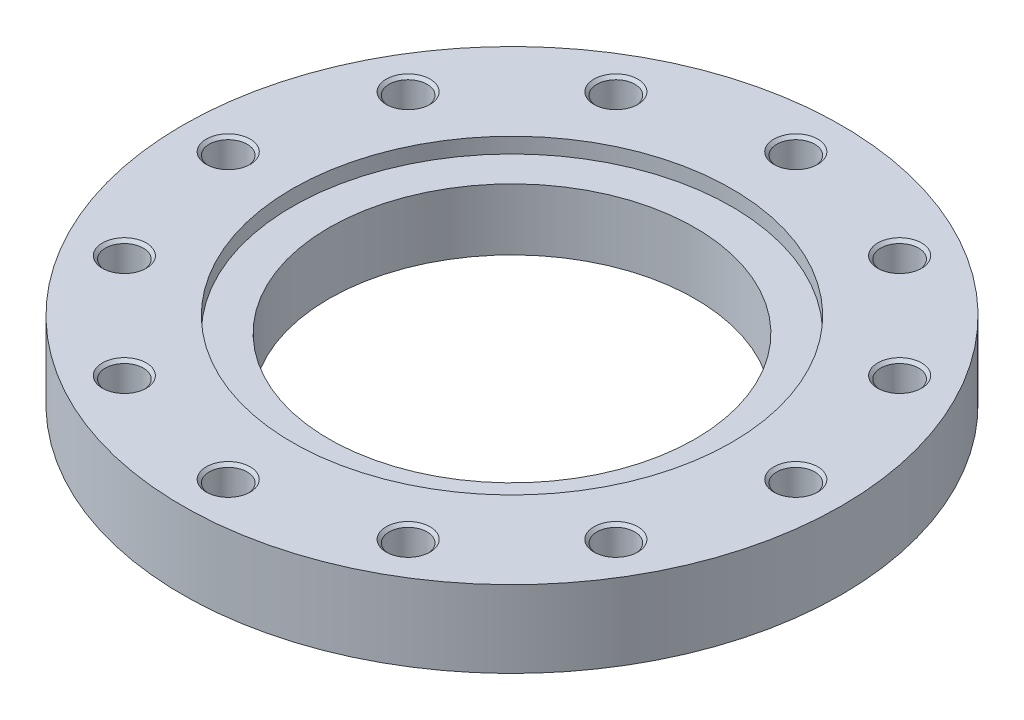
ISO-10303-21;
HEADER;
FILE_DESCRIPTION(('STEP AP214'),'2;1');
FILE_NAME('part.step','',(''),(''),'','','');
FILE_SCHEMA(('AUTOMOTIVE_DESIGN { 1 0 10303 214 1 1 1 1 }'));
ENDSEC;
DATA;
#1=APPLICATION_CONTEXT('core data for automotive mechanical design processes');
#2=APPLICATION_PROTOCOL_DEFINITION('international standard','automotive_design',2000,#1);
#3=PRODUCT_CONTEXT('',#1,'mechanical');
#4=PRODUCT('Part','Part','',(#3));
#5=PRODUCT_RELATED_PRODUCT_CATEGORY('part','',(#4));
#6=PRODUCT_DEFINITION_FORMATION('','',#4);
#7=PRODUCT_DEFINITION_CONTEXT('part definition',#1,'design');
#8=PRODUCT_DEFINITION('design','',#6,#7);
#9=PRODUCT_DEFINITION_SHAPE('','',#8);
#10=(LENGTH_UNIT() NAMED_UNIT(*) SI_UNIT(.MILLI.,.METRE.));
#11=(NAMED_UNIT(*) PLANE_ANGLE_UNIT() SI_UNIT($,.RADIAN.));
#12=(NAMED_UNIT(*) SI_UNIT($,.STERADIAN.) SOLID_ANGLE_UNIT());
#13=UNCERTAINTY_MEASURE_WITH_UNIT(LENGTH_MEASURE(1.E-05),#10,'distance_accuracy_value','');
#14=(GEOMETRIC_REPRESENTATION_CONTEXT(3) GLOBAL_UNCERTAINTY_ASSIGNED_CONTEXT((#13)) GLOBAL_UNIT_ASSIGNED_CONTEXT((#10,
#11,#12)) REPRESENTATION_CONTEXT('',''));
#15=CARTESIAN_POINT('',(0.,0.,0.));
#16=DIRECTION('',(0.,0.,1.));
#17=DIRECTION('',(1.,0.,0.));
#18=AXIS2_PLACEMENT_3D('',#15,#16,#17);
#19=CARTESIAN_POINT('',(0.,21.,0.));
#20=DIRECTION('',(0.,-1.,0.));
#21=DIRECTION('',(1.,0.,0.));
#22=AXIS2_PLACEMENT_3D('',#19,#20,#21);
#23=CYLINDRICAL_SURFACE('',#22,180.);
#24=CARTESIAN_POINT('',(0.,0.,0.));
#25=DIRECTION('',(0.,1.,0.));
#26=DIRECTION('',(1.,0.,0.));
#27=AXIS2_PLACEMENT_3D('',#24,#25,#26);
#28=CIRCLE('',#27,180.);
#29=CARTESIAN_POINT('',(180.,0.,0.));
#30=VERTEX_POINT('',#29);
#31=EDGE_CURVE('E9',#30,#30,#28,.T.);
#32=ORIENTED_EDGE('',*,*,#31,.T.);
#33=EDGE_LOOP('',(#32));
#34=FACE_BOUND('',#33,.T.);
#35=CARTESIAN_POINT('',(0.,42.,0.));
#36=DIRECTION('',(0.,1.,0.));
#37=DIRECTION('',(1.,0.,0.));
#38=AXIS2_PLACEMENT_3D('',#35,#36,#37);
#39=CIRCLE('',#38,180.);
#40=CARTESIAN_POINT('',(180.,42.,0.));
#41=VERTEX_POINT('',#40);
#42=EDGE_CURVE('E258',#41,#41,#39,.T.);
#43=ORIENTED_EDGE('',*,*,#42,.F.);
#44=EDGE_LOOP('',(#43));
#45=FACE_BOUND('',#44,.T.);
#46=ADVANCED_FACE('F15',(#34,#45),#23,.T.);
#47=CARTESIAN_POINT('',(140.,0.,0.));
#48=DIRECTION('',(0.,-1.,0.));
#49=DIRECTION('',(-1.,0.,0.));
#50=AXIS2_PLACEMENT_3D('',#47,#48,#49);
#51=PLANE('',#50);
#52=CARTESIAN_POINT('',(0.,0.,0.));
#53=DIRECTION('',(0.,1.,0.));
#54=DIRECTION('',(1.,0.,0.));
#55=AXIS2_PLACEMENT_3D('',#52,#53,#54);
#56=CIRCLE('',#55,100.);
#57=CARTESIAN_POINT('',(100.,0.,0.));
#58=VERTEX_POINT('',#57);
#59=EDGE_CURVE('E22',#58,#58,#56,.T.);
#60=ORIENTED_EDGE('',*,*,#59,.T.);
#61=EDGE_LOOP('',(#60));
#62=FACE_BOUND('',#61,.T.);
#63=ORIENTED_EDGE('',*,*,#31,.F.);
#64=EDGE_LOOP('',(#63));
#65=FACE_BOUND('',#64,.T.);
#66=ADVANCED_FACE('F427',(#62,#65),#51,.T.);
#67=CARTESIAN_POINT('',(0.,21.,0.));
#68=DIRECTION('',(0.,-1.,0.));
#69=DIRECTION('',(1.,0.,0.));
#70=AXIS2_PLACEMENT_3D('',#67,#68,#69);
#71=CYLINDRICAL_SURFACE('',#70,100.);
#72=ORIENTED_EDGE('',*,*,#59,.F.);
#73=EDGE_LOOP('',(#72));
#74=FACE_BOUND('',#73,.T.);
#75=CARTESIAN_POINT('',(0.,33.6,0.));
#76=DIRECTION('',(0.,1.,0.));
#77=DIRECTION('',(1.,0.,0.));
#78=AXIS2_PLACEMENT_3D('',#75,#76,#77);
#79=CIRCLE('',#78,100.);
#80=CARTESIAN_POINT('',(-100.,33.6,0.));
#81=VERTEX_POINT('',#80);
#82=EDGE_CURVE('E252',#81,#81,#79,.T.);
#83=ORIENTED_EDGE('',*,*,#82,.T.);
#84=EDGE_LOOP('',(#83));
#85=FACE_BOUND('',#84,.T.);
#86=ADVANCED_FACE('F431',(#74,#85),#71,.F.);
#87=CARTESIAN_POINT('',(140.,42.,0.));
#88=DIRECTION('',(0.,1.,0.));
#89=DIRECTION('',(1.,0.,0.));
#90=AXIS2_PLACEMENT_3D('',#87,#88,#89);
#91=PLANE('',#90);
#92=ORIENTED_EDGE('',*,*,#42,.T.);
#93=EDGE_LOOP('',(#92));
#94=FACE_BOUND('',#93,.T.);
#95=CARTESIAN_POINT('',(0.,42.,0.));
#96=DIRECTION('',(0.,-1.,0.));
#97=DIRECTION('',(1.,0.,0.));
#98=AXIS2_PLACEMENT_3D('',#95,#96,#97);
#99=CIRCLE('',#98,120.);
#100=CARTESIAN_POINT('',(-120.,42.,0.));
#101=VERTEX_POINT('',#100);
#102=EDGE_CURVE('E245',#101,#101,#99,.T.);
#103=ORIENTED_EDGE('',*,*,#102,.T.);
#104=EDGE_LOOP('',(#103));
#105=FACE_BOUND('',#104,.T.);
#106=CARTESIAN_POINT('',(155.,42.,0.));
#107=DIRECTION('',(0.,-1.,0.));
#108=DIRECTION('',(1.,0.,0.));
#109=AXIS2_PLACEMENT_3D('',#106,#107,#108);
#110=CIRCLE('',#109,12.);
#111=CARTESIAN_POINT('',(167.,42.,0.));
#112=VERTEX_POINT('',#111);
#113=EDGE_CURVE('E399',#112,#112,#110,.T.);
#114=ORIENTED_EDGE('',*,*,#113,.T.);
#115=EDGE_LOOP('',(#114));
#116=FACE_BOUND('',#115,.T.);
#117=CARTESIAN_POINT('',(134.233937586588,42.,-77.5));
#118=DIRECTION('',(0.,-1.,0.));
#119=DIRECTION('',(0.866025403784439,0.,-0.5));
#120=AXIS2_PLACEMENT_3D('',#117,#118,#119);
#121=CIRCLE('',#120,12.);
#122=CARTESIAN_POINT('',(144.626242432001,42.,-83.5));
#123=VERTEX_POINT('',#122);
#124=EDGE_CURVE('E387',#123,#123,#121,.T.);
#125=ORIENTED_EDGE('',*,*,#124,.T.);
#126=EDGE_LOOP('',(#125));
#127=FACE_BOUND('',#126,.T.);
#128=CARTESIAN_POINT('',(77.5,42.,-134.233937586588));
#129=DIRECTION('',(0.,-1.,0.));
#130=DIRECTION('',(0.5,0.,-0.866025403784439));
#131=AXIS2_PLACEMENT_3D('',#128,#129,#130);
#132=CIRCLE('',#131,12.);
#133=CARTESIAN_POINT('',(83.5,42.,-144.626242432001));
#134=VERTEX_POINT('',#133);
#135=EDGE_CURVE('E302',#134,#134,#132,.T.);
#136=ORIENTED_EDGE('',*,*,#135,.T.);
#137=EDGE_LOOP('',(#136));
#138=FACE_BOUND('',#137,.T.);
#139=CARTESIAN_POINT('',(0.,42.,-155.));
#140=DIRECTION('',(0.,-1.,0.));
#141=DIRECTION('',(0.,0.,-1.));
#142=AXIS2_PLACEMENT_3D('',#139,#140,#141);
#143=CIRCLE('',#142,12.);
#144=CARTESIAN_POINT('',(0.,42.,-167.));
#145=VERTEX_POINT('',#144);
#146=EDGE_CURVE('E368',#145,#145,#143,.T.);
#147=ORIENTED_EDGE('',*,*,#146,.T.);
#148=EDGE_LOOP('',(#147));
#149=FACE_BOUND('',#148,.T.);
#150=CARTESIAN_POINT('',(-77.5,42.,-134.233937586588));
#151=DIRECTION('',(0.,-1.,0.));
#152=DIRECTION('',(-0.5,0.,-0.866025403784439));
#153=AXIS2_PLACEMENT_3D('',#150,#151,#152);
#154=CIRCLE('',#153,12.);
#155=CARTESIAN_POINT('',(-83.5,42.,-144.626242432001));
#156=VERTEX_POINT('',#155);
#157=EDGE_CURVE('E327',#156,#156,#154,.T.);
#158=ORIENTED_EDGE('',*,*,#157,.T.);
#159=EDGE_LOOP('',(#158));
#160=FACE_BOUND('',#159,.T.);
#161=CARTESIAN_POINT('',(-134.233937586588,42.,-77.5));
#162=DIRECTION('',(0.,-1.,0.));
#163=DIRECTION('',(-0.866025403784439,0.,-0.5));
#164=AXIS2_PLACEMENT_3D('',#161,#162,#163);
#165=CIRCLE('',#164,12.);
#166=CARTESIAN_POINT('',(-144.626242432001,42.,-83.5));
#167=VERTEX_POINT('',#166);
#168=EDGE_CURVE('E353',#167,#167,#165,.T.);
#169=ORIENTED_EDGE('',*,*,#168,.T.);
#170=EDGE_LOOP('',(#169));
#171=FACE_BOUND('',#170,.T.);
#172=CARTESIAN_POINT('',(-155.,42.,0.));
#173=DIRECTION('',(0.,-1.,0.));
#174=DIRECTION('',(-1.,0.,0.));
#175=AXIS2_PLACEMENT_3D('',#172,#173,#174);
#176=CIRCLE('',#175,12.);
#177=CARTESIAN_POINT('',(-167.,42.,0.));
#178=VERTEX_POINT('',#177);
#179=EDGE_CURVE('E341',#178,#178,#176,.T.);
#180=ORIENTED_EDGE('',*,*,#179,.T.);
#181=EDGE_LOOP('',(#180));
#182=FACE_BOUND('',#181,.T.);
#183=CARTESIAN_POINT('',(-134.233937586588,42.,77.5));
#184=DIRECTION('',(0.,-1.,0.));
#185=DIRECTION('',(-0.866025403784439,0.,0.5));
#186=AXIS2_PLACEMENT_3D('',#183,#184,#185);
#187=CIRCLE('',#186,12.);
#188=CARTESIAN_POINT('',(-144.626242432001,42.,83.5));
#189=VERTEX_POINT('',#188);
#190=EDGE_CURVE('E323',#189,#189,#187,.T.);
#191=ORIENTED_EDGE('',*,*,#190,.T.);
#192=EDGE_LOOP('',(#191));
#193=FACE_BOUND('',#192,.T.);
#194=CARTESIAN_POINT('',(-77.5,42.,134.233937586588));
#195=DIRECTION('',(0.,-1.,0.));
#196=DIRECTION('',(-0.5,0.,0.866025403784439));
#197=AXIS2_PLACEMENT_3D('',#194,#195,#196);
#198=CIRCLE('',#197,12.);
#199=CARTESIAN_POINT('',(-83.5,42.,144.626242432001));
#200=VERTEX_POINT('',#199);
#201=EDGE_CURVE('E307',#200,#200,#198,.T.);
#202=ORIENTED_EDGE('',*,*,#201,.T.);
#203=EDGE_LOOP('',(#202));
#204=FACE_BOUND('',#203,.T.);
#205=CARTESIAN_POINT('',(0.,42.,155.));
#206=DIRECTION('',(0.,-1.,0.));
#207=DIRECTION('',(0.,0.,1.));
#208=AXIS2_PLACEMENT_3D('',#205,#206,#207);
#209=CIRCLE('',#208,12.);
#210=CARTESIAN_POINT('',(0.,42.,167.));
#211=VERTEX_POINT('',#210);
#212=EDGE_CURVE('E282',#211,#211,#209,.T.);
#213=ORIENTED_EDGE('',*,*,#212,.T.);
#214=EDGE_LOOP('',(#213));
#215=FACE_BOUND('',#214,.T.);
#216=CARTESIAN_POINT('',(77.5,42.,134.233937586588));
#217=DIRECTION('',(0.,-1.,0.));
#218=DIRECTION('',(0.5,0.,0.866025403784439));
#219=AXIS2_PLACEMENT_3D('',#216,#217,#218);
#220=CIRCLE('',#219,12.);
#221=CARTESIAN_POINT('',(83.5,42.,144.626242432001));
#222=VERTEX_POINT('',#221);
#223=EDGE_CURVE('E272',#222,#222,#220,.T.);
#224=ORIENTED_EDGE('',*,*,#223,.T.);
#225=EDGE_LOOP('',(#224));
#226=FACE_BOUND('',#225,.T.);
#227=CARTESIAN_POINT('',(134.233937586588,42.,77.5));
#228=DIRECTION('',(0.,-1.,0.));
#229=DIRECTION('',(0.866025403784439,0.,0.5));
#230=AXIS2_PLACEMENT_3D('',#227,#228,#229);
#231=CIRCLE('',#230,12.);
#232=CARTESIAN_POINT('',(144.626242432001,42.,83.5));
#233=VERTEX_POINT('',#232);
#234=EDGE_CURVE('E1200',#233,#233,#231,.T.);
#235=ORIENTED_EDGE('',*,*,#234,.T.);
#236=EDGE_LOOP('',(#235));
#237=FACE_BOUND('',#236,.T.);
#238=ADVANCED_FACE('F246',(#94,#105,#116,#127,#138,#149,#160,#171,#182,#193,#204,#215,#226,
#237),#91,.T.);
#239=CARTESIAN_POINT('',(0.,33.6,0.));
#240=DIRECTION('',(0.,-1.,0.));
#241=DIRECTION('',(-1.,0.,0.));
#242=AXIS2_PLACEMENT_3D('',#239,#240,#241);
#243=PLANE('',#242);
#244=CARTESIAN_POINT('',(0.,33.6,0.));
#245=DIRECTION('',(0.,-1.,0.));
#246=DIRECTION('',(1.,0.,0.));
#247=AXIS2_PLACEMENT_3D('',#244,#245,#246);
#248=CIRCLE('',#247,120.);
#249=CARTESIAN_POINT('',(120.,33.6,0.));
#250=VERTEX_POINT('',#249);
#251=EDGE_CURVE('E249',#250,#250,#248,.T.);
#252=ORIENTED_EDGE('',*,*,#251,.F.);
#253=EDGE_LOOP('',(#252));
#254=FACE_BOUND('',#253,.T.);
#255=ORIENTED_EDGE('',*,*,#82,.F.);
#256=EDGE_LOOP('',(#255));
#257=FACE_BOUND('',#256,.T.);
#258=ADVANCED_FACE('F423',(#254,#257),#243,.F.);
#259=CARTESIAN_POINT('',(0.,39.9,0.));
#260=DIRECTION('',(0.,-1.,0.));
#261=DIRECTION('',(1.,0.,0.));
#262=AXIS2_PLACEMENT_3D('',#259,#260,#261);
#263=CYLINDRICAL_SURFACE('',#262,120.);
#264=ORIENTED_EDGE('',*,*,#251,.T.);
#265=EDGE_LOOP('',(#264));
#266=FACE_BOUND('',#265,.T.);
#267=ORIENTED_EDGE('',*,*,#102,.F.);
#268=EDGE_LOOP('',(#267));
#269=FACE_BOUND('',#268,.T.);
#270=ADVANCED_FACE('F417',(#266,#269),#263,.F.);
#271=CARTESIAN_POINT('',(155.,6.00463463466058,0.));
#272=DIRECTION('',(0.,1.,0.));
#273=DIRECTION('',(1.,0.,0.));
#274=AXIS2_PLACEMENT_3D('',#271,#272,#273);
#275=CONICAL_SURFACE('',#274,5.188125,1.0471975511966);
#276=CARTESIAN_POINT('',(155.,9.,0.));
#277=DIRECTION('',(0.,-1.,0.));
#278=DIRECTION('',(1.,0.,0.));
#279=AXIS2_PLACEMENT_3D('',#276,#277,#278);
#280=CIRCLE('',#279,10.37625);
#281=CARTESIAN_POINT('',(165.37625,9.,0.));
#282=VERTEX_POINT('',#281);
#283=EDGE_CURVE('E250',#282,#282,#280,.T.);
#284=ORIENTED_EDGE('',*,*,#283,.F.);
#285=EDGE_LOOP('',(#284));
#286=FACE_BOUND('',#285,.T.);
#287=CARTESIAN_POINT('',(155.,3.00926926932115,0.));
#288=VERTEX_POINT('',#287);
#289=VERTEX_LOOP('',#288);
#290=FACE_BOUND('',#289,.T.);
#291=ADVANCED_FACE('F411',(#286,#290),#275,.F.);
#292=CARTESIAN_POINT('',(155.,12.688125,0.));
#293=DIRECTION('',(0.,1.,0.));
#294=DIRECTION('',(1.,0.,0.));
#295=AXIS2_PLACEMENT_3D('',#292,#293,#294);
#296=CYLINDRICAL_SURFACE('',#295,10.37625);
#297=CARTESIAN_POINT('',(155.,16.37625,0.));
#298=DIRECTION('',(0.,-1.,0.));
#299=DIRECTION('',(1.,0.,0.));
#300=AXIS2_PLACEMENT_3D('',#297,#298,#299);
#301=CIRCLE('',#300,10.37625);
#302=CARTESIAN_POINT('',(165.37625,16.37625,0.));
#303=VERTEX_POINT('',#302);
#304=EDGE_CURVE('E254',#303,#303,#301,.T.);
#305=ORIENTED_EDGE('',*,*,#304,.F.);
#306=EDGE_LOOP('',(#305));
#307=FACE_BOUND('',#306,.T.);
#308=ORIENTED_EDGE('',*,*,#283,.T.);
#309=EDGE_LOOP('',(#308));
#310=FACE_BOUND('',#309,.T.);
#311=ADVANCED_FACE('F408',(#307,#310),#296,.F.);
#312=CARTESIAN_POINT('',(155.,17.188125,0.));
#313=DIRECTION('',(0.,1.,0.));
#314=DIRECTION('',(1.,0.,0.));
#315=AXIS2_PLACEMENT_3D('',#312,#313,#314);
#316=CONICAL_SURFACE('',#315,11.188125,0.785398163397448);
#317=CARTESIAN_POINT('',(155.,18.,0.));
#318=DIRECTION('',(0.,-1.,0.));
#319=DIRECTION('',(1.,0.,0.));
#320=AXIS2_PLACEMENT_3D('',#317,#318,#319);
#321=CIRCLE('',#320,12.);
#322=CARTESIAN_POINT('',(167.,18.,0.));
#323=VERTEX_POINT('',#322);
#324=EDGE_CURVE('E403',#323,#323,#321,.T.);
#325=ORIENTED_EDGE('',*,*,#324,.F.);
#326=EDGE_LOOP('',(#325));
#327=FACE_BOUND('',#326,.T.);
#328=ORIENTED_EDGE('',*,*,#304,.T.);
#329=EDGE_LOOP('',(#328));
#330=FACE_BOUND('',#329,.T.);
#331=ADVANCED_FACE('F406',(#327,#330),#316,.F.);
#332=CARTESIAN_POINT('',(166.188125,18.,0.));
#333=DIRECTION('',(0.,1.,0.));
#334=DIRECTION('',(-1.,0.,0.));
#335=AXIS2_PLACEMENT_3D('',#332,#333,#334);
#336=PLANE('',#335);
#337=CARTESIAN_POINT('',(155.,18.,0.));
#338=DIRECTION('',(0.,-1.,0.));
#339=DIRECTION('',(1.,0.,0.));
#340=AXIS2_PLACEMENT_3D('',#337,#338,#339);
#341=CIRCLE('',#340,10.37625);
#342=CARTESIAN_POINT('',(165.37625,18.,0.));
#343=VERTEX_POINT('',#342);
#344=EDGE_CURVE('E401',#343,#343,#341,.T.);
#345=ORIENTED_EDGE('',*,*,#344,.F.);
#346=EDGE_LOOP('',(#345));
#347=FACE_BOUND('',#346,.T.);
#348=ORIENTED_EDGE('',*,*,#324,.T.);
#349=EDGE_LOOP('',(#348));
#350=FACE_BOUND('',#349,.T.);
#351=ADVANCED_FACE('F701',(#347,#350),#336,.F.);
#352=CARTESIAN_POINT('',(155.,29.188125,0.));
#353=DIRECTION('',(0.,1.,0.));
#354=DIRECTION('',(1.,0.,0.));
#355=AXIS2_PLACEMENT_3D('',#352,#353,#354);
#356=CYLINDRICAL_SURFACE('',#355,10.37625);
#357=CARTESIAN_POINT('',(155.,40.37625,0.));
#358=DIRECTION('',(0.,-1.,0.));
#359=DIRECTION('',(1.,0.,0.));
#360=AXIS2_PLACEMENT_3D('',#357,#358,#359);
#361=CIRCLE('',#360,10.37625);
#362=CARTESIAN_POINT('',(165.37625,40.37625,0.));
#363=VERTEX_POINT('',#362);
#364=EDGE_CURVE('E397',#363,#363,#361,.T.);
#365=ORIENTED_EDGE('',*,*,#364,.F.);
#366=EDGE_LOOP('',(#365));
#367=FACE_BOUND('',#366,.T.);
#368=ORIENTED_EDGE('',*,*,#344,.T.);
#369=EDGE_LOOP('',(#368));
#370=FACE_BOUND('',#369,.T.);
#371=ADVANCED_FACE('F697',(#367,#370),#356,.F.);
#372=CARTESIAN_POINT('',(155.,41.188125,0.));
#373=DIRECTION('',(0.,1.,0.));
#374=DIRECTION('',(1.,0.,0.));
#375=AXIS2_PLACEMENT_3D('',#372,#373,#374);
#376=CONICAL_SURFACE('',#375,11.188125,0.785398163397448);
#377=ORIENTED_EDGE('',*,*,#113,.F.);
#378=EDGE_LOOP('',(#377));
#379=FACE_BOUND('',#378,.T.);
#380=ORIENTED_EDGE('',*,*,#364,.T.);
#381=EDGE_LOOP('',(#380));
#382=FACE_BOUND('',#381,.T.);
#383=ADVANCED_FACE('F693',(#379,#382),#376,.F.);
#384=CARTESIAN_POINT('',(134.233937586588,6.00463463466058,-77.5));
#385=DIRECTION('',(0.,1.,0.));
#386=DIRECTION('',(0.866025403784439,0.,-0.5));
#387=AXIS2_PLACEMENT_3D('',#384,#385,#386);
#388=CONICAL_SURFACE('',#387,5.188125,1.0471975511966);
#389=CARTESIAN_POINT('',(134.233937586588,9.,-77.5));
#390=DIRECTION('',(0.,-1.,0.));
#391=DIRECTION('',(0.866025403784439,0.,-0.5));
#392=AXIS2_PLACEMENT_3D('',#389,#390,#391);
#393=CIRCLE('',#392,10.37625);
#394=CARTESIAN_POINT('',(143.220033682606,9.,-82.688125));
#395=VERTEX_POINT('',#394);
#396=EDGE_CURVE('E395',#395,#395,#393,.T.);
#397=ORIENTED_EDGE('',*,*,#396,.F.);
#398=EDGE_LOOP('',(#397));
#399=FACE_BOUND('',#398,.T.);
#400=CARTESIAN_POINT('',(134.233937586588,3.00926926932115,-77.5));
#401=VERTEX_POINT('',#400);
#402=VERTEX_LOOP('',#401);
#403=FACE_BOUND('',#402,.T.);
#404=ADVANCED_FACE('F689',(#399,#403),#388,.F.);
#405=CARTESIAN_POINT('',(134.233937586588,12.688125,-77.5));
#406=DIRECTION('',(0.,1.,0.));
#407=DIRECTION('',(0.866025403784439,0.,-0.5));
#408=AXIS2_PLACEMENT_3D('',#405,#406,#407);
#409=CYLINDRICAL_SURFACE('',#408,10.37625);
#410=CARTESIAN_POINT('',(134.233937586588,16.37625,-77.5));
#411=DIRECTION('',(0.,-1.,0.));
#412=DIRECTION('',(0.866025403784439,0.,-0.5));
#413=AXIS2_PLACEMENT_3D('',#410,#411,#412);
#414=CIRCLE('',#413,10.37625);
#415=CARTESIAN_POINT('',(143.220033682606,16.37625,-82.688125));
#416=VERTEX_POINT('',#415);
#417=EDGE_CURVE('E393',#416,#416,#414,.T.);
#418=ORIENTED_EDGE('',*,*,#417,.F.);
#419=EDGE_LOOP('',(#418));
#420=FACE_BOUND('',#419,.T.);
#421=ORIENTED_EDGE('',*,*,#396,.T.);
#422=EDGE_LOOP('',(#421));
#423=FACE_BOUND('',#422,.T.);
#424=ADVANCED_FACE('F685',(#420,#423),#409,.F.);
#425=CARTESIAN_POINT('',(134.233937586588,17.188125,-77.5));
#426=DIRECTION('',(0.,1.,0.));
#427=DIRECTION('',(0.866025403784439,0.,-0.5));
#428=AXIS2_PLACEMENT_3D('',#425,#426,#427);
#429=CONICAL_SURFACE('',#428,11.188125,0.785398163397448);
#430=CARTESIAN_POINT('',(134.233937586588,18.,-77.5));
#431=DIRECTION('',(0.,-1.,0.));
#432=DIRECTION('',(0.866025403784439,0.,-0.5));
#433=AXIS2_PLACEMENT_3D('',#430,#431,#432);
#434=CIRCLE('',#433,12.);
#435=CARTESIAN_POINT('',(144.626242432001,18.,-83.5));
#436=VERTEX_POINT('',#435);
#437=EDGE_CURVE('E391',#436,#436,#434,.T.);
#438=ORIENTED_EDGE('',*,*,#437,.F.);
#439=EDGE_LOOP('',(#438));
#440=FACE_BOUND('',#439,.T.);
#441=ORIENTED_EDGE('',*,*,#417,.T.);
#442=EDGE_LOOP('',(#441));
#443=FACE_BOUND('',#442,.T.);
#444=ADVANCED_FACE('F681',(#440,#443),#429,.F.);
#445=CARTESIAN_POINT('',(143.923138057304,18.,-83.0940625));
#446=DIRECTION('',(0.,1.,0.));
#447=DIRECTION('',(-0.866025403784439,0.,0.5));
#448=AXIS2_PLACEMENT_3D('',#445,#446,#447);
#449=PLANE('',#448);
#450=CARTESIAN_POINT('',(134.233937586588,18.,-77.5));
#451=DIRECTION('',(0.,-1.,0.));
#452=DIRECTION('',(0.866025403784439,0.,-0.5));
#453=AXIS2_PLACEMENT_3D('',#450,#451,#452);
#454=CIRCLE('',#453,10.37625);
#455=CARTESIAN_POINT('',(143.220033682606,18.,-82.688125));
#456=VERTEX_POINT('',#455);
#457=EDGE_CURVE('E389',#456,#456,#454,.T.);
#458=ORIENTED_EDGE('',*,*,#457,.F.);
#459=EDGE_LOOP('',(#458));
#460=FACE_BOUND('',#459,.T.);
#461=ORIENTED_EDGE('',*,*,#437,.T.);
#462=EDGE_LOOP('',(#461));
#463=FACE_BOUND('',#462,.T.);
#464=ADVANCED_FACE('F677',(#460,#463),#449,.F.);
#465=CARTESIAN_POINT('',(134.233937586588,29.188125,-77.5));
#466=DIRECTION('',(0.,1.,0.));
#467=DIRECTION('',(0.866025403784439,0.,-0.5));
#468=AXIS2_PLACEMENT_3D('',#465,#466,#467);
#469=CYLINDRICAL_SURFACE('',#468,10.37625);
#470=CARTESIAN_POINT('',(134.233937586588,40.37625,-77.5));
#471=DIRECTION('',(0.,-1.,0.));
#472=DIRECTION('',(0.866025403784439,0.,-0.5));
#473=AXIS2_PLACEMENT_3D('',#470,#471,#472);
#474=CIRCLE('',#473,10.37625);
#475=CARTESIAN_POINT('',(143.220033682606,40.37625,-82.688125));
#476=VERTEX_POINT('',#475);
#477=EDGE_CURVE('E385',#476,#476,#474,.T.);
#478=ORIENTED_EDGE('',*,*,#477,.F.);
#479=EDGE_LOOP('',(#478));
#480=FACE_BOUND('',#479,.T.);
#481=ORIENTED_EDGE('',*,*,#457,.T.);
#482=EDGE_LOOP('',(#481));
#483=FACE_BOUND('',#482,.T.);
#484=ADVANCED_FACE('F478',(#480,#483),#469,.F.);
#485=CARTESIAN_POINT('',(134.233937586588,41.188125,-77.5));
#486=DIRECTION('',(0.,1.,0.));
#487=DIRECTION('',(0.866025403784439,0.,-0.5));
#488=AXIS2_PLACEMENT_3D('',#485,#486,#487);
#489=CONICAL_SURFACE('',#488,11.188125,0.785398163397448);
#490=ORIENTED_EDGE('',*,*,#124,.F.);
#491=EDGE_LOOP('',(#490));
#492=FACE_BOUND('',#491,.T.);
#493=ORIENTED_EDGE('',*,*,#477,.T.);
#494=EDGE_LOOP('',(#493));
#495=FACE_BOUND('',#494,.T.);
#496=ADVANCED_FACE('F474',(#492,#495),#489,.F.);
#497=CARTESIAN_POINT('',(77.5,6.00463463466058,-134.233937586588));
#498=DIRECTION('',(0.,1.,0.));
#499=DIRECTION('',(0.5,0.,-0.866025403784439));
#500=AXIS2_PLACEMENT_3D('',#497,#498,#499);
#501=CONICAL_SURFACE('',#500,5.188125,1.0471975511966);
#502=CARTESIAN_POINT('',(77.5,9.,-134.233937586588));
#503=DIRECTION('',(0.,-1.,0.));
#504=DIRECTION('',(0.5,0.,-0.866025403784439));
#505=AXIS2_PLACEMENT_3D('',#502,#503,#504);
#506=CIRCLE('',#505,10.37625);
#507=CARTESIAN_POINT('',(82.688125,9.,-143.220033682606));
#508=VERTEX_POINT('',#507);
#509=EDGE_CURVE('E383',#508,#508,#506,.T.);
#510=ORIENTED_EDGE('',*,*,#509,.F.);
#511=EDGE_LOOP('',(#510));
#512=FACE_BOUND('',#511,.T.);
#513=CARTESIAN_POINT('',(77.5,3.00926926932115,-134.233937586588));
#514=VERTEX_POINT('',#513);
#515=VERTEX_LOOP('',#514);
#516=FACE_BOUND('',#515,.T.);
#517=ADVANCED_FACE('F477',(#512,#516),#501,.F.);
#518=CARTESIAN_POINT('',(77.5,12.688125,-134.233937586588));
#519=DIRECTION('',(0.,1.,0.));
#520=DIRECTION('',(0.5,0.,-0.866025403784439));
#521=AXIS2_PLACEMENT_3D('',#518,#519,#520);
#522=CYLINDRICAL_SURFACE('',#521,10.37625);
#523=CARTESIAN_POINT('',(77.5,16.37625,-134.233937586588));
#524=DIRECTION('',(0.,-1.,0.));
#525=DIRECTION('',(0.5,0.,-0.866025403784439));
#526=AXIS2_PLACEMENT_3D('',#523,#524,#525);
#527=CIRCLE('',#526,10.37625);
#528=CARTESIAN_POINT('',(82.688125,16.37625,-143.220033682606));
#529=VERTEX_POINT('',#528);
#530=EDGE_CURVE('E381',#529,#529,#527,.T.);
#531=ORIENTED_EDGE('',*,*,#530,.F.);
#532=EDGE_LOOP('',(#531));
#533=FACE_BOUND('',#532,.T.);
#534=ORIENTED_EDGE('',*,*,#509,.T.);
#535=EDGE_LOOP('',(#534));
#536=FACE_BOUND('',#535,.T.);
#537=ADVANCED_FACE('F667',(#533,#536),#522,.F.);
#538=CARTESIAN_POINT('',(77.5,17.188125,-134.233937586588));
#539=DIRECTION('',(0.,1.,0.));
#540=DIRECTION('',(0.5,0.,-0.866025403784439));
#541=AXIS2_PLACEMENT_3D('',#538,#539,#540);
#542=CONICAL_SURFACE('',#541,11.188125,0.785398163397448);
#543=CARTESIAN_POINT('',(77.5,18.,-134.233937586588));
#544=DIRECTION('',(0.,-1.,0.));
#545=DIRECTION('',(0.5,0.,-0.866025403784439));
#546=AXIS2_PLACEMENT_3D('',#543,#544,#545);
#547=CIRCLE('',#546,12.);
#548=CARTESIAN_POINT('',(83.5,18.,-144.626242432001));
#549=VERTEX_POINT('',#548);
#550=EDGE_CURVE('E379',#549,#549,#547,.T.);
#551=ORIENTED_EDGE('',*,*,#550,.F.);
#552=EDGE_LOOP('',(#551));
#553=FACE_BOUND('',#552,.T.);
#554=ORIENTED_EDGE('',*,*,#530,.T.);
#555=EDGE_LOOP('',(#554));
#556=FACE_BOUND('',#555,.T.);
#557=ADVANCED_FACE('F663',(#553,#556),#542,.F.);
#558=CARTESIAN_POINT('',(83.0940625,18.,-143.923138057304));
#559=DIRECTION('',(0.,1.,0.));
#560=DIRECTION('',(-0.5,0.,0.866025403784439));
#561=AXIS2_PLACEMENT_3D('',#558,#559,#560);
#562=PLANE('',#561);
#563=CARTESIAN_POINT('',(77.5,18.,-134.233937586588));
#564=DIRECTION('',(0.,-1.,0.));
#565=DIRECTION('',(0.5,0.,-0.866025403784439));
#566=AXIS2_PLACEMENT_3D('',#563,#564,#565);
#567=CIRCLE('',#566,10.37625);
#568=CARTESIAN_POINT('',(82.688125,18.,-143.220033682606));
#569=VERTEX_POINT('',#568);
#570=EDGE_CURVE('E304',#569,#569,#567,.T.);
#571=ORIENTED_EDGE('',*,*,#570,.F.);
#572=EDGE_LOOP('',(#571));
#573=FACE_BOUND('',#572,.T.);
#574=ORIENTED_EDGE('',*,*,#550,.T.);
#575=EDGE_LOOP('',(#574));
#576=FACE_BOUND('',#575,.T.);
#577=ADVANCED_FACE('F659',(#573,#576),#562,.F.);
#578=CARTESIAN_POINT('',(77.5,29.188125,-134.233937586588));
#579=DIRECTION('',(0.,1.,0.));
#580=DIRECTION('',(0.5,0.,-0.866025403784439));
#581=AXIS2_PLACEMENT_3D('',#578,#579,#580);
#582=CYLINDRICAL_SURFACE('',#581,10.37625);
#583=CARTESIAN_POINT('',(77.5,40.37625,-134.233937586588));
#584=DIRECTION('',(0.,-1.,0.));
#585=DIRECTION('',(0.5,0.,-0.866025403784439));
#586=AXIS2_PLACEMENT_3D('',#583,#584,#585);
#587=CIRCLE('',#586,10.37625);
#588=CARTESIAN_POINT('',(82.688125,40.37625,-143.220033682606));
#589=VERTEX_POINT('',#588);
#590=EDGE_CURVE('E305',#589,#589,#587,.T.);
#591=ORIENTED_EDGE('',*,*,#590,.F.);
#592=EDGE_LOOP('',(#591));
#593=FACE_BOUND('',#592,.T.);
#594=ORIENTED_EDGE('',*,*,#570,.T.);
#595=EDGE_LOOP('',(#594));
#596=FACE_BOUND('',#595,.T.);
#597=ADVANCED_FACE('F655',(#593,#596),#582,.F.);
#598=CARTESIAN_POINT('',(77.5,41.188125,-134.233937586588));
#599=DIRECTION('',(0.,1.,0.));
#600=DIRECTION('',(0.5,0.,-0.866025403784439));
#601=AXIS2_PLACEMENT_3D('',#598,#599,#600);
#602=CONICAL_SURFACE('',#601,11.188125,0.785398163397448);
#603=ORIENTED_EDGE('',*,*,#135,.F.);
#604=EDGE_LOOP('',(#603));
#605=FACE_BOUND('',#604,.T.);
#606=ORIENTED_EDGE('',*,*,#590,.T.);
#607=EDGE_LOOP('',(#606));
#608=FACE_BOUND('',#607,.T.);
#609=ADVANCED_FACE('F651',(#605,#608),#602,.F.);
#610=CARTESIAN_POINT('',(0.,6.00463463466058,-155.));
#611=DIRECTION('',(0.,1.,0.));
#612=DIRECTION('',(0.,0.,-1.));
#613=AXIS2_PLACEMENT_3D('',#610,#611,#612);
#614=CONICAL_SURFACE('',#613,5.188125,1.0471975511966);
#615=CARTESIAN_POINT('',(0.,9.,-155.));
#616=DIRECTION('',(0.,-1.,0.));
#617=DIRECTION('',(0.,0.,-1.));
#618=AXIS2_PLACEMENT_3D('',#615,#616,#617);
#619=CIRCLE('',#618,10.37625);
#620=CARTESIAN_POINT('',(0.,9.,-165.37625));
#621=VERTEX_POINT('',#620);
#622=EDGE_CURVE('E375',#621,#621,#619,.T.);
#623=ORIENTED_EDGE('',*,*,#622,.F.);
#624=EDGE_LOOP('',(#623));
#625=FACE_BOUND('',#624,.T.);
#626=CARTESIAN_POINT('',(0.,3.00926926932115,-155.));
#627=VERTEX_POINT('',#626);
#628=VERTEX_LOOP('',#627);
#629=FACE_BOUND('',#628,.T.);
#630=ADVANCED_FACE('F647',(#625,#629),#614,.F.);
#631=CARTESIAN_POINT('',(0.,12.688125,-155.));
#632=DIRECTION('',(0.,1.,0.));
#633=DIRECTION('',(0.,0.,-1.));
#634=AXIS2_PLACEMENT_3D('',#631,#632,#633);
#635=CYLINDRICAL_SURFACE('',#634,10.37625);
#636=CARTESIAN_POINT('',(0.,16.37625,-155.));
#637=DIRECTION('',(0.,-1.,0.));
#638=DIRECTION('',(0.,0.,-1.));
#639=AXIS2_PLACEMENT_3D('',#636,#637,#638);
#640=CIRCLE('',#639,10.37625);
#641=CARTESIAN_POINT('',(0.,16.37625,-165.37625));
#642=VERTEX_POINT('',#641);
#643=EDGE_CURVE('E373',#642,#642,#640,.T.);
#644=ORIENTED_EDGE('',*,*,#643,.F.);
#645=EDGE_LOOP('',(#644));
#646=FACE_BOUND('',#645,.T.);
#647=ORIENTED_EDGE('',*,*,#622,.T.);
#648=EDGE_LOOP('',(#647));
#649=FACE_BOUND('',#648,.T.);
#650=ADVANCED_FACE('F643',(#646,#649),#635,.F.);
#651=CARTESIAN_POINT('',(0.,17.188125,-155.));
#652=DIRECTION('',(0.,1.,0.));
#653=DIRECTION('',(0.,0.,-1.));
#654=AXIS2_PLACEMENT_3D('',#651,#652,#653);
#655=CONICAL_SURFACE('',#654,11.188125,0.785398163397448);
#656=CARTESIAN_POINT('',(0.,18.,-155.));
#657=DIRECTION('',(0.,-1.,0.));
#658=DIRECTION('',(0.,0.,-1.));
#659=AXIS2_PLACEMENT_3D('',#656,#657,#658);
#660=CIRCLE('',#659,12.);
#661=CARTESIAN_POINT('',(0.,18.,-167.));
#662=VERTEX_POINT('',#661);
#663=EDGE_CURVE('E372',#662,#662,#660,.T.);
#664=ORIENTED_EDGE('',*,*,#663,.F.);
#665=EDGE_LOOP('',(#664));
#666=FACE_BOUND('',#665,.T.);
#667=ORIENTED_EDGE('',*,*,#643,.T.);
#668=EDGE_LOOP('',(#667));
#669=FACE_BOUND('',#668,.T.);
#670=ADVANCED_FACE('F581',(#666,#669),#655,.F.);
#671=CARTESIAN_POINT('',(0.,18.,-166.188125));
#672=DIRECTION('',(0.,1.,0.));
#673=DIRECTION('',(0.,0.,1.));
#674=AXIS2_PLACEMENT_3D('',#671,#672,#673);
#675=PLANE('',#674);
#676=CARTESIAN_POINT('',(0.,18.,-155.));
#677=DIRECTION('',(0.,-1.,0.));
#678=DIRECTION('',(0.,0.,-1.));
#679=AXIS2_PLACEMENT_3D('',#676,#677,#678);
#680=CIRCLE('',#679,10.37625);
#681=CARTESIAN_POINT('',(0.,18.,-165.37625));
#682=VERTEX_POINT('',#681);
#683=EDGE_CURVE('E370',#682,#682,#680,.T.);
#684=ORIENTED_EDGE('',*,*,#683,.F.);
#685=EDGE_LOOP('',(#684));
#686=FACE_BOUND('',#685,.T.);
#687=ORIENTED_EDGE('',*,*,#663,.T.);
#688=EDGE_LOOP('',(#687));
#689=FACE_BOUND('',#688,.T.);
#690=ADVANCED_FACE('F577',(#686,#689),#675,.F.);
#691=CARTESIAN_POINT('',(0.,29.188125,-155.));
#692=DIRECTION('',(0.,1.,0.));
#693=DIRECTION('',(0.,0.,-1.));
#694=AXIS2_PLACEMENT_3D('',#691,#692,#693);
#695=CYLINDRICAL_SURFACE('',#694,10.37625);
#696=CARTESIAN_POINT('',(0.,40.37625,-155.));
#697=DIRECTION('',(0.,-1.,0.));
#698=DIRECTION('',(0.,0.,-1.));
#699=AXIS2_PLACEMENT_3D('',#696,#697,#698);
#700=CIRCLE('',#699,10.37625);
#701=CARTESIAN_POINT('',(0.,40.37625,-165.37625));
#702=VERTEX_POINT('',#701);
#703=EDGE_CURVE('E366',#702,#702,#700,.T.);
#704=ORIENTED_EDGE('',*,*,#703,.F.);
#705=EDGE_LOOP('',(#704));
#706=FACE_BOUND('',#705,.T.);
#707=ORIENTED_EDGE('',*,*,#683,.T.);
#708=EDGE_LOOP('',(#707));
#709=FACE_BOUND('',#708,.T.);
#710=ADVANCED_FACE('F580',(#706,#709),#695,.F.);
#711=CARTESIAN_POINT('',(0.,41.188125,-155.));
#712=DIRECTION('',(0.,1.,0.));
#713=DIRECTION('',(0.,0.,-1.));
#714=AXIS2_PLACEMENT_3D('',#711,#712,#713);
#715=CONICAL_SURFACE('',#714,11.188125,0.785398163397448);
#716=ORIENTED_EDGE('',*,*,#146,.F.);
#717=EDGE_LOOP('',(#716));
#718=FACE_BOUND('',#717,.T.);
#719=ORIENTED_EDGE('',*,*,#703,.T.);
#720=EDGE_LOOP('',(#719));
#721=FACE_BOUND('',#720,.T.);
#722=ADVANCED_FACE('F633',(#718,#721),#715,.F.);
#723=CARTESIAN_POINT('',(-77.5,6.00463463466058,-134.233937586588));
#724=DIRECTION('',(0.,1.,0.));
#725=DIRECTION('',(-0.5,0.,-0.866025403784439));
#726=AXIS2_PLACEMENT_3D('',#723,#724,#725);
#727=CONICAL_SURFACE('',#726,5.188125,1.0471975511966);
#728=CARTESIAN_POINT('',(-77.5,9.,-134.233937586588));
#729=DIRECTION('',(0.,-1.,0.));
#730=DIRECTION('',(-0.5,0.,-0.866025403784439));
#731=AXIS2_PLACEMENT_3D('',#728,#729,#730);
#732=CIRCLE('',#731,10.37625);
#733=CARTESIAN_POINT('',(-82.688125,9.,-143.220033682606));
#734=VERTEX_POINT('',#733);
#735=EDGE_CURVE('E364',#734,#734,#732,.T.);
#736=ORIENTED_EDGE('',*,*,#735,.F.);
#737=EDGE_LOOP('',(#736));
#738=FACE_BOUND('',#737,.T.);
#739=CARTESIAN_POINT('',(-77.5,3.00926926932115,-134.233937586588));
#740=VERTEX_POINT('',#739);
#741=VERTEX_LOOP('',#740);
#742=FACE_BOUND('',#741,.T.);
#743=ADVANCED_FACE('F551',(#738,#742),#727,.F.);
#744=CARTESIAN_POINT('',(-77.5,12.688125,-134.233937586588));
#745=DIRECTION('',(0.,1.,0.));
#746=DIRECTION('',(-0.5,0.,-0.866025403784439));
#747=AXIS2_PLACEMENT_3D('',#744,#745,#746);
#748=CYLINDRICAL_SURFACE('',#747,10.37625);
#749=CARTESIAN_POINT('',(-77.5,16.37625,-134.233937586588));
#750=DIRECTION('',(0.,-1.,0.));
#751=DIRECTION('',(-0.5,0.,-0.866025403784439));
#752=AXIS2_PLACEMENT_3D('',#749,#750,#751);
#753=CIRCLE('',#752,10.37625);
#754=CARTESIAN_POINT('',(-82.688125,16.37625,-143.220033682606));
#755=VERTEX_POINT('',#754);
#756=EDGE_CURVE('E333',#755,#755,#753,.T.);
#757=ORIENTED_EDGE('',*,*,#756,.F.);
#758=EDGE_LOOP('',(#757));
#759=FACE_BOUND('',#758,.T.);
#760=ORIENTED_EDGE('',*,*,#735,.T.);
#761=EDGE_LOOP('',(#760));
#762=FACE_BOUND('',#761,.T.);
#763=ADVANCED_FACE('F547',(#759,#762),#748,.F.);
#764=CARTESIAN_POINT('',(-77.5,17.188125,-134.233937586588));
#765=DIRECTION('',(0.,1.,0.));
#766=DIRECTION('',(-0.5,0.,-0.866025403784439));
#767=AXIS2_PLACEMENT_3D('',#764,#765,#766);
#768=CONICAL_SURFACE('',#767,11.188125,0.785398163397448);
#769=CARTESIAN_POINT('',(-77.5,18.,-134.233937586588));
#770=DIRECTION('',(0.,-1.,0.));
#771=DIRECTION('',(-0.5,0.,-0.866025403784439));
#772=AXIS2_PLACEMENT_3D('',#769,#770,#771);
#773=CIRCLE('',#772,12.);
#774=CARTESIAN_POINT('',(-83.5,18.,-144.626242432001));
#775=VERTEX_POINT('',#774);
#776=EDGE_CURVE('E326',#775,#775,#773,.T.);
#777=ORIENTED_EDGE('',*,*,#776,.F.);
#778=EDGE_LOOP('',(#777));
#779=FACE_BOUND('',#778,.T.);
#780=ORIENTED_EDGE('',*,*,#756,.T.);
#781=EDGE_LOOP('',(#780));
#782=FACE_BOUND('',#781,.T.);
#783=ADVANCED_FACE('F550',(#779,#782),#768,.F.);
#784=CARTESIAN_POINT('',(-83.0940625,18.,-143.923138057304));
#785=DIRECTION('',(0.,1.,0.));
#786=DIRECTION('',(0.5,0.,0.866025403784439));
#787=AXIS2_PLACEMENT_3D('',#784,#785,#786);
#788=PLANE('',#787);
#789=CARTESIAN_POINT('',(-77.5,18.,-134.233937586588));
#790=DIRECTION('',(0.,-1.,0.));
#791=DIRECTION('',(-0.5,0.,-0.866025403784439));
#792=AXIS2_PLACEMENT_3D('',#789,#790,#791);
#793=CIRCLE('',#792,10.37625);
#794=CARTESIAN_POINT('',(-82.688125,18.,-143.220033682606));
#795=VERTEX_POINT('',#794);
#796=EDGE_CURVE('E324',#795,#795,#793,.T.);
#797=ORIENTED_EDGE('',*,*,#796,.F.);
#798=EDGE_LOOP('',(#797));
#799=FACE_BOUND('',#798,.T.);
#800=ORIENTED_EDGE('',*,*,#776,.T.);
#801=EDGE_LOOP('',(#800));
#802=FACE_BOUND('',#801,.T.);
#803=ADVANCED_FACE('F623',(#799,#802),#788,.F.);
#804=CARTESIAN_POINT('',(-77.5,29.188125,-134.233937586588));
#805=DIRECTION('',(0.,1.,0.));
#806=DIRECTION('',(-0.5,0.,-0.866025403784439));
#807=AXIS2_PLACEMENT_3D('',#804,#805,#806);
#808=CYLINDRICAL_SURFACE('',#807,10.37625);
#809=CARTESIAN_POINT('',(-77.5,40.37625,-134.233937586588));
#810=DIRECTION('',(0.,-1.,0.));
#811=DIRECTION('',(-0.5,0.,-0.866025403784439));
#812=AXIS2_PLACEMENT_3D('',#809,#810,#811);
#813=CIRCLE('',#812,10.37625);
#814=CARTESIAN_POINT('',(-82.688125,40.37625,-143.220033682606));
#815=VERTEX_POINT('',#814);
#816=EDGE_CURVE('E314',#815,#815,#813,.T.);
#817=ORIENTED_EDGE('',*,*,#816,.F.);
#818=EDGE_LOOP('',(#817));
#819=FACE_BOUND('',#818,.T.);
#820=ORIENTED_EDGE('',*,*,#796,.T.);
#821=EDGE_LOOP('',(#820));
#822=FACE_BOUND('',#821,.T.);
#823=ADVANCED_FACE('F619',(#819,#822),#808,.F.);
#824=CARTESIAN_POINT('',(-77.5,41.188125,-134.233937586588));
#825=DIRECTION('',(0.,1.,0.));
#826=DIRECTION('',(-0.5,0.,-0.866025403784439));
#827=AXIS2_PLACEMENT_3D('',#824,#825,#826);
#828=CONICAL_SURFACE('',#827,11.188125,0.785398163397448);
#829=ORIENTED_EDGE('',*,*,#157,.F.);
#830=EDGE_LOOP('',(#829));
#831=FACE_BOUND('',#830,.T.);
#832=ORIENTED_EDGE('',*,*,#816,.T.);
#833=EDGE_LOOP('',(#832));
#834=FACE_BOUND('',#833,.T.);
#835=ADVANCED_FACE('F615',(#831,#834),#828,.F.);
#836=CARTESIAN_POINT('',(-134.233937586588,6.00463463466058,-77.5));
#837=DIRECTION('',(0.,1.,0.));
#838=DIRECTION('',(-0.866025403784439,0.,-0.5));
#839=AXIS2_PLACEMENT_3D('',#836,#837,#838);
#840=CONICAL_SURFACE('',#839,5.188125,1.0471975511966);
#841=CARTESIAN_POINT('',(-134.233937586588,9.,-77.5));
#842=DIRECTION('',(0.,-1.,0.));
#843=DIRECTION('',(-0.866025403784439,0.,-0.5));
#844=AXIS2_PLACEMENT_3D('',#841,#842,#843);
#845=CIRCLE('',#844,10.37625);
#846=CARTESIAN_POINT('',(-143.220033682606,9.,-82.688125));
#847=VERTEX_POINT('',#846);
#848=EDGE_CURVE('E312',#847,#847,#845,.T.);
#849=ORIENTED_EDGE('',*,*,#848,.F.);
#850=EDGE_LOOP('',(#849));
#851=FACE_BOUND('',#850,.T.);
#852=CARTESIAN_POINT('',(-134.233937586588,3.00926926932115,-77.5));
#853=VERTEX_POINT('',#852);
#854=VERTEX_LOOP('',#853);
#855=FACE_BOUND('',#854,.T.);
#856=ADVANCED_FACE('F529',(#851,#855),#840,.F.);
#857=CARTESIAN_POINT('',(-134.233937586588,12.688125,-77.5));
#858=DIRECTION('',(0.,1.,0.));
#859=DIRECTION('',(-0.866025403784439,0.,-0.5));
#860=AXIS2_PLACEMENT_3D('',#857,#858,#859);
#861=CYLINDRICAL_SURFACE('',#860,10.37625);
#862=CARTESIAN_POINT('',(-134.233937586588,16.37625,-77.5));
#863=DIRECTION('',(0.,-1.,0.));
#864=DIRECTION('',(-0.866025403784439,0.,-0.5));
#865=AXIS2_PLACEMENT_3D('',#862,#863,#864);
#866=CIRCLE('',#865,10.37625);
#867=CARTESIAN_POINT('',(-143.220033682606,16.37625,-82.688125));
#868=VERTEX_POINT('',#867);
#869=EDGE_CURVE('E315',#868,#868,#866,.T.);
#870=ORIENTED_EDGE('',*,*,#869,.F.);
#871=EDGE_LOOP('',(#870));
#872=FACE_BOUND('',#871,.T.);
#873=ORIENTED_EDGE('',*,*,#848,.T.);
#874=EDGE_LOOP('',(#873));
#875=FACE_BOUND('',#874,.T.);
#876=ADVANCED_FACE('F525',(#872,#875),#861,.F.);
#877=CARTESIAN_POINT('',(-134.233937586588,17.188125,-77.5));
#878=DIRECTION('',(0.,1.,0.));
#879=DIRECTION('',(-0.866025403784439,0.,-0.5));
#880=AXIS2_PLACEMENT_3D('',#877,#878,#879);
#881=CONICAL_SURFACE('',#880,11.188125,0.785398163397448);
#882=CARTESIAN_POINT('',(-134.233937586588,18.,-77.5));
#883=DIRECTION('',(0.,-1.,0.));
#884=DIRECTION('',(-0.866025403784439,0.,-0.5));
#885=AXIS2_PLACEMENT_3D('',#882,#883,#884);
#886=CIRCLE('',#885,12.);
#887=CARTESIAN_POINT('',(-144.626242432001,18.,-83.5));
#888=VERTEX_POINT('',#887);
#889=EDGE_CURVE('E357',#888,#888,#886,.T.);
#890=ORIENTED_EDGE('',*,*,#889,.F.);
#891=EDGE_LOOP('',(#890));
#892=FACE_BOUND('',#891,.T.);
#893=ORIENTED_EDGE('',*,*,#869,.T.);
#894=EDGE_LOOP('',(#893));
#895=FACE_BOUND('',#894,.T.);
#896=ADVANCED_FACE('F528',(#892,#895),#881,.F.);
#897=CARTESIAN_POINT('',(-143.923138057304,18.,-83.0940625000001));
#898=DIRECTION('',(0.,1.,0.));
#899=DIRECTION('',(0.866025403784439,0.,0.5));
#900=AXIS2_PLACEMENT_3D('',#897,#898,#899);
#901=PLANE('',#900);
#902=CARTESIAN_POINT('',(-134.233937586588,18.,-77.5));
#903=DIRECTION('',(0.,-1.,0.));
#904=DIRECTION('',(-0.866025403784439,0.,-0.5));
#905=AXIS2_PLACEMENT_3D('',#902,#903,#904);
#906=CIRCLE('',#905,10.37625);
#907=CARTESIAN_POINT('',(-143.220033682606,18.,-82.688125));
#908=VERTEX_POINT('',#907);
#909=EDGE_CURVE('E355',#908,#908,#906,.T.);
#910=ORIENTED_EDGE('',*,*,#909,.F.);
#911=EDGE_LOOP('',(#910));
#912=FACE_BOUND('',#911,.T.);
#913=ORIENTED_EDGE('',*,*,#889,.T.);
#914=EDGE_LOOP('',(#913));
#915=FACE_BOUND('',#914,.T.);
#916=ADVANCED_FACE('F605',(#912,#915),#901,.F.);
#917=CARTESIAN_POINT('',(-134.233937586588,29.188125,-77.5));
#918=DIRECTION('',(0.,1.,0.));
#919=DIRECTION('',(-0.866025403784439,0.,-0.5));
#920=AXIS2_PLACEMENT_3D('',#917,#918,#919);
#921=CYLINDRICAL_SURFACE('',#920,10.37625);
#922=CARTESIAN_POINT('',(-134.233937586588,40.37625,-77.5));
#923=DIRECTION('',(0.,-1.,0.));
#924=DIRECTION('',(-0.866025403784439,0.,-0.5));
#925=AXIS2_PLACEMENT_3D('',#922,#923,#924);
#926=CIRCLE('',#925,10.37625);
#927=CARTESIAN_POINT('',(-143.220033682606,40.37625,-82.688125));
#928=VERTEX_POINT('',#927);
#929=EDGE_CURVE('E351',#928,#928,#926,.T.);
#930=ORIENTED_EDGE('',*,*,#929,.F.);
#931=EDGE_LOOP('',(#930));
#932=FACE_BOUND('',#931,.T.);
#933=ORIENTED_EDGE('',*,*,#909,.T.);
#934=EDGE_LOOP('',(#933));
#935=FACE_BOUND('',#934,.T.);
#936=ADVANCED_FACE('F601',(#932,#935),#921,.F.);
#937=CARTESIAN_POINT('',(-134.233937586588,41.188125,-77.5));
#938=DIRECTION('',(0.,1.,0.));
#939=DIRECTION('',(-0.866025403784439,0.,-0.5));
#940=AXIS2_PLACEMENT_3D('',#937,#938,#939);
#941=CONICAL_SURFACE('',#940,11.188125,0.785398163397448);
#942=ORIENTED_EDGE('',*,*,#168,.F.);
#943=EDGE_LOOP('',(#942));
#944=FACE_BOUND('',#943,.T.);
#945=ORIENTED_EDGE('',*,*,#929,.T.);
#946=EDGE_LOOP('',(#945));
#947=FACE_BOUND('',#946,.T.);
#948=ADVANCED_FACE('F597',(#944,#947),#941,.F.);
#949=CARTESIAN_POINT('',(-155.,6.00463463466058,0.));
#950=DIRECTION('',(0.,1.,0.));
#951=DIRECTION('',(-1.,0.,0.));
#952=AXIS2_PLACEMENT_3D('',#949,#950,#951);
#953=CONICAL_SURFACE('',#952,5.188125,1.0471975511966);
#954=CARTESIAN_POINT('',(-155.,9.,0.));
#955=DIRECTION('',(0.,-1.,0.));
#956=DIRECTION('',(-1.,0.,0.));
#957=AXIS2_PLACEMENT_3D('',#954,#955,#956);
#958=CIRCLE('',#957,10.37625);
#959=CARTESIAN_POINT('',(-165.37625,9.,0.));
#960=VERTEX_POINT('',#959);
#961=EDGE_CURVE('E349',#960,#960,#958,.T.);
#962=ORIENTED_EDGE('',*,*,#961,.F.);
#963=EDGE_LOOP('',(#962));
#964=FACE_BOUND('',#963,.T.);
#965=CARTESIAN_POINT('',(-155.,3.00926926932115,0.));
#966=VERTEX_POINT('',#965);
#967=VERTEX_LOOP('',#966);
#968=FACE_BOUND('',#967,.T.);
#969=ADVANCED_FACE('F593',(#964,#968),#953,.F.);
#970=CARTESIAN_POINT('',(-155.,12.688125,0.));
#971=DIRECTION('',(0.,1.,0.));
#972=DIRECTION('',(-1.,0.,0.));
#973=AXIS2_PLACEMENT_3D('',#970,#971,#972);
#974=CYLINDRICAL_SURFACE('',#973,10.37625);
#975=CARTESIAN_POINT('',(-155.,16.37625,0.));
#976=DIRECTION('',(0.,-1.,0.));
#977=DIRECTION('',(-1.,0.,0.));
#978=AXIS2_PLACEMENT_3D('',#975,#976,#977);
#979=CIRCLE('',#978,10.37625);
#980=CARTESIAN_POINT('',(-165.37625,16.37625,0.));
#981=VERTEX_POINT('',#980);
#982=EDGE_CURVE('E347',#981,#981,#979,.T.);
#983=ORIENTED_EDGE('',*,*,#982,.F.);
#984=EDGE_LOOP('',(#983));
#985=FACE_BOUND('',#984,.T.);
#986=ORIENTED_EDGE('',*,*,#961,.T.);
#987=EDGE_LOOP('',(#986));
#988=FACE_BOUND('',#987,.T.);
#989=ADVANCED_FACE('F589',(#985,#988),#974,.F.);
#990=CARTESIAN_POINT('',(-155.,17.188125,0.));
#991=DIRECTION('',(0.,1.,0.));
#992=DIRECTION('',(-1.,0.,0.));
#993=AXIS2_PLACEMENT_3D('',#990,#991,#992);
#994=CONICAL_SURFACE('',#993,11.188125,0.785398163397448);
#995=CARTESIAN_POINT('',(-155.,18.,0.));
#996=DIRECTION('',(0.,-1.,0.));
#997=DIRECTION('',(-1.,0.,0.));
#998=AXIS2_PLACEMENT_3D('',#995,#996,#997);
#999=CIRCLE('',#998,12.);
#1000=CARTESIAN_POINT('',(-167.,18.,0.));
#1001=VERTEX_POINT('',#1000);
#1002=EDGE_CURVE('E345',#1001,#1001,#999,.T.);
#1003=ORIENTED_EDGE('',*,*,#1002,.F.);
#1004=EDGE_LOOP('',(#1003));
#1005=FACE_BOUND('',#1004,.T.);
#1006=ORIENTED_EDGE('',*,*,#982,.T.);
#1007=EDGE_LOOP('',(#1006));
#1008=FACE_BOUND('',#1007,.T.);
#1009=ADVANCED_FACE('F585',(#1005,#1008),#994,.F.);
#1010=CARTESIAN_POINT('',(-166.188125,18.,0.));
#1011=DIRECTION('',(0.,1.,0.));
#1012=DIRECTION('',(1.,0.,0.));
#1013=AXIS2_PLACEMENT_3D('',#1010,#1011,#1012);
#1014=PLANE('',#1013);
#1015=CARTESIAN_POINT('',(-155.,18.,0.));
#1016=DIRECTION('',(0.,-1.,0.));
#1017=DIRECTION('',(-1.,0.,0.));
#1018=AXIS2_PLACEMENT_3D('',#1015,#1016,#1017);
#1019=CIRCLE('',#1018,10.37625);
#1020=CARTESIAN_POINT('',(-165.37625,18.,0.));
#1021=VERTEX_POINT('',#1020);
#1022=EDGE_CURVE('E343',#1021,#1021,#1019,.T.);
#1023=ORIENTED_EDGE('',*,*,#1022,.F.);
#1024=EDGE_LOOP('',(#1023));
#1025=FACE_BOUND('',#1024,.T.);
#1026=ORIENTED_EDGE('',*,*,#1002,.T.);
#1027=EDGE_LOOP('',(#1026));
#1028=FACE_BOUND('',#1027,.T.);
#1029=ADVANCED_FACE('F575',(#1025,#1028),#1014,.F.);
#1030=CARTESIAN_POINT('',(-155.,29.188125,0.));
#1031=DIRECTION('',(0.,1.,0.));
#1032=DIRECTION('',(-1.,0.,0.));
#1033=AXIS2_PLACEMENT_3D('',#1030,#1031,#1032);
#1034=CYLINDRICAL_SURFACE('',#1033,10.37625);
#1035=CARTESIAN_POINT('',(-155.,40.37625,0.));
#1036=DIRECTION('',(0.,-1.,0.));
#1037=DIRECTION('',(-1.,0.,0.));
#1038=AXIS2_PLACEMENT_3D('',#1035,#1036,#1037);
#1039=CIRCLE('',#1038,10.37625);
#1040=CARTESIAN_POINT('',(-165.37625,40.37625,0.));
#1041=VERTEX_POINT('',#1040);
#1042=EDGE_CURVE('E339',#1041,#1041,#1039,.T.);
#1043=ORIENTED_EDGE('',*,*,#1042,.F.);
#1044=EDGE_LOOP('',(#1043));
#1045=FACE_BOUND('',#1044,.T.);
#1046=ORIENTED_EDGE('',*,*,#1022,.T.);
#1047=EDGE_LOOP('',(#1046));
#1048=FACE_BOUND('',#1047,.T.);
#1049=ADVANCED_FACE('F571',(#1045,#1048),#1034,.F.);
#1050=CARTESIAN_POINT('',(-155.,41.188125,0.));
#1051=DIRECTION('',(0.,1.,0.));
#1052=DIRECTION('',(-1.,0.,0.));
#1053=AXIS2_PLACEMENT_3D('',#1050,#1051,#1052);
#1054=CONICAL_SURFACE('',#1053,11.188125,0.785398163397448);
#1055=ORIENTED_EDGE('',*,*,#179,.F.);
#1056=EDGE_LOOP('',(#1055));
#1057=FACE_BOUND('',#1056,.T.);
#1058=ORIENTED_EDGE('',*,*,#1042,.T.);
#1059=EDGE_LOOP('',(#1058));
#1060=FACE_BOUND('',#1059,.T.);
#1061=ADVANCED_FACE('F567',(#1057,#1060),#1054,.F.);
#1062=CARTESIAN_POINT('',(-134.233937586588,6.00463463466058,77.5));
#1063=DIRECTION('',(0.,1.,0.));
#1064=DIRECTION('',(-0.866025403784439,0.,0.5));
#1065=AXIS2_PLACEMENT_3D('',#1062,#1063,#1064);
#1066=CONICAL_SURFACE('',#1065,5.188125,1.0471975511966);
#1067=CARTESIAN_POINT('',(-134.233937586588,9.,77.5));
#1068=DIRECTION('',(0.,-1.,0.));
#1069=DIRECTION('',(-0.866025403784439,0.,0.5));
#1070=AXIS2_PLACEMENT_3D('',#1067,#1068,#1069);
#1071=CIRCLE('',#1070,10.37625);
#1072=CARTESIAN_POINT('',(-143.220033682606,9.,82.688125));
#1073=VERTEX_POINT('',#1072);
#1074=EDGE_CURVE('E337',#1073,#1073,#1071,.T.);
#1075=ORIENTED_EDGE('',*,*,#1074,.F.);
#1076=EDGE_LOOP('',(#1075));
#1077=FACE_BOUND('',#1076,.T.);
#1078=CARTESIAN_POINT('',(-134.233937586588,3.00926926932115,77.5));
#1079=VERTEX_POINT('',#1078);
#1080=VERTEX_LOOP('',#1079);
#1081=FACE_BOUND('',#1080,.T.);
#1082=ADVANCED_FACE('F563',(#1077,#1081),#1066,.F.);
#1083=CARTESIAN_POINT('',(-134.233937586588,12.688125,77.5));
#1084=DIRECTION('',(0.,1.,0.));
#1085=DIRECTION('',(-0.866025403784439,0.,0.5));
#1086=AXIS2_PLACEMENT_3D('',#1083,#1084,#1085);
#1087=CYLINDRICAL_SURFACE('',#1086,10.37625);
#1088=CARTESIAN_POINT('',(-134.233937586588,16.37625,77.5));
#1089=DIRECTION('',(0.,-1.,0.));
#1090=DIRECTION('',(-0.866025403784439,0.,0.5));
#1091=AXIS2_PLACEMENT_3D('',#1088,#1089,#1090);
#1092=CIRCLE('',#1091,10.37625);
#1093=CARTESIAN_POINT('',(-143.220033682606,16.37625,82.688125));
#1094=VERTEX_POINT('',#1093);
#1095=EDGE_CURVE('E335',#1094,#1094,#1092,.T.);
#1096=ORIENTED_EDGE('',*,*,#1095,.F.);
#1097=EDGE_LOOP('',(#1096));
#1098=FACE_BOUND('',#1097,.T.);
#1099=ORIENTED_EDGE('',*,*,#1074,.T.);
#1100=EDGE_LOOP('',(#1099));
#1101=FACE_BOUND('',#1100,.T.);
#1102=ADVANCED_FACE('F559',(#1098,#1101),#1087,.F.);
#1103=CARTESIAN_POINT('',(-134.233937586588,17.188125,77.5));
#1104=DIRECTION('',(0.,1.,0.));
#1105=DIRECTION('',(-0.866025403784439,0.,0.5));
#1106=AXIS2_PLACEMENT_3D('',#1103,#1104,#1105);
#1107=CONICAL_SURFACE('',#1106,11.188125,0.785398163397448);
#1108=CARTESIAN_POINT('',(-134.233937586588,18.,77.5));
#1109=DIRECTION('',(0.,-1.,0.));
#1110=DIRECTION('',(-0.866025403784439,0.,0.5));
#1111=AXIS2_PLACEMENT_3D('',#1108,#1109,#1110);
#1112=CIRCLE('',#1111,12.);
#1113=CARTESIAN_POINT('',(-144.626242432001,18.,83.5));
#1114=VERTEX_POINT('',#1113);
#1115=EDGE_CURVE('E331',#1114,#1114,#1112,.T.);
#1116=ORIENTED_EDGE('',*,*,#1115,.F.);
#1117=EDGE_LOOP('',(#1116));
#1118=FACE_BOUND('',#1117,.T.);
#1119=ORIENTED_EDGE('',*,*,#1095,.T.);
#1120=EDGE_LOOP('',(#1119));
#1121=FACE_BOUND('',#1120,.T.);
#1122=ADVANCED_FACE('F555',(#1118,#1121),#1107,.F.);
#1123=CARTESIAN_POINT('',(-143.923138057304,18.,83.0940625));
#1124=DIRECTION('',(0.,1.,0.));
#1125=DIRECTION('',(0.866025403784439,0.,-0.5));
#1126=AXIS2_PLACEMENT_3D('',#1123,#1124,#1125);
#1127=PLANE('',#1126);
#1128=CARTESIAN_POINT('',(-134.233937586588,18.,77.5));
#1129=DIRECTION('',(0.,-1.,0.));
#1130=DIRECTION('',(-0.866025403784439,0.,0.5));
#1131=AXIS2_PLACEMENT_3D('',#1128,#1129,#1130);
#1132=CIRCLE('',#1131,10.37625);
#1133=CARTESIAN_POINT('',(-143.220033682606,18.,82.688125));
#1134=VERTEX_POINT('',#1133);
#1135=EDGE_CURVE('E329',#1134,#1134,#1132,.T.);
#1136=ORIENTED_EDGE('',*,*,#1135,.F.);
#1137=EDGE_LOOP('',(#1136));
#1138=FACE_BOUND('',#1137,.T.);
#1139=ORIENTED_EDGE('',*,*,#1115,.T.);
#1140=EDGE_LOOP('',(#1139));
#1141=FACE_BOUND('',#1140,.T.);
#1142=ADVANCED_FACE('F545',(#1138,#1141),#1127,.F.);
#1143=CARTESIAN_POINT('',(-134.233937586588,29.188125,77.5));
#1144=DIRECTION('',(0.,1.,0.));
#1145=DIRECTION('',(-0.866025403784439,0.,0.5));
#1146=AXIS2_PLACEMENT_3D('',#1143,#1144,#1145);
#1147=CYLINDRICAL_SURFACE('',#1146,10.37625);
#1148=CARTESIAN_POINT('',(-134.233937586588,40.37625,77.5));
#1149=DIRECTION('',(0.,-1.,0.));
#1150=DIRECTION('',(-0.866025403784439,0.,0.5));
#1151=AXIS2_PLACEMENT_3D('',#1148,#1149,#1150);
#1152=CIRCLE('',#1151,10.37625);
#1153=CARTESIAN_POINT('',(-143.220033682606,40.37625,82.688125));
#1154=VERTEX_POINT('',#1153);
#1155=EDGE_CURVE('E321',#1154,#1154,#1152,.T.);
#1156=ORIENTED_EDGE('',*,*,#1155,.F.);
#1157=EDGE_LOOP('',(#1156));
#1158=FACE_BOUND('',#1157,.T.);
#1159=ORIENTED_EDGE('',*,*,#1135,.T.);
#1160=EDGE_LOOP('',(#1159));
#1161=FACE_BOUND('',#1160,.T.);
#1162=ADVANCED_FACE('F541',(#1158,#1161),#1147,.F.);
#1163=CARTESIAN_POINT('',(-134.233937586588,41.188125,77.5));
#1164=DIRECTION('',(0.,1.,0.));
#1165=DIRECTION('',(-0.866025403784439,0.,0.5));
#1166=AXIS2_PLACEMENT_3D('',#1163,#1164,#1165);
#1167=CONICAL_SURFACE('',#1166,11.188125,0.785398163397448);
#1168=ORIENTED_EDGE('',*,*,#190,.F.);
#1169=EDGE_LOOP('',(#1168));
#1170=FACE_BOUND('',#1169,.T.);
#1171=ORIENTED_EDGE('',*,*,#1155,.T.);
#1172=EDGE_LOOP('',(#1171));
#1173=FACE_BOUND('',#1172,.T.);
#1174=ADVANCED_FACE('F537',(#1170,#1173),#1167,.F.);
#1175=CARTESIAN_POINT('',(-77.5,6.00463463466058,134.233937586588));
#1176=DIRECTION('',(0.,1.,0.));
#1177=DIRECTION('',(-0.5,0.,0.866025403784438));
#1178=AXIS2_PLACEMENT_3D('',#1175,#1176,#1177);
#1179=CONICAL_SURFACE('',#1178,5.188125,1.0471975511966);
#1180=CARTESIAN_POINT('',(-77.5,9.,134.233937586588));
#1181=DIRECTION('',(0.,-1.,0.));
#1182=DIRECTION('',(-0.5,0.,0.866025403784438));
#1183=AXIS2_PLACEMENT_3D('',#1180,#1181,#1182);
#1184=CIRCLE('',#1183,10.37625);
#1185=CARTESIAN_POINT('',(-82.6881250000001,9.,143.220033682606));
#1186=VERTEX_POINT('',#1185);
#1187=EDGE_CURVE('E319',#1186,#1186,#1184,.T.);
#1188=ORIENTED_EDGE('',*,*,#1187,.F.);
#1189=EDGE_LOOP('',(#1188));
#1190=FACE_BOUND('',#1189,.T.);
#1191=CARTESIAN_POINT('',(-77.5,3.00926926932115,134.233937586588));
#1192=VERTEX_POINT('',#1191);
#1193=VERTEX_LOOP('',#1192);
#1194=FACE_BOUND('',#1193,.T.);
#1195=ADVANCED_FACE('F533',(#1190,#1194),#1179,.F.);
#1196=CARTESIAN_POINT('',(-77.5,12.688125,134.233937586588));
#1197=DIRECTION('',(0.,1.,0.));
#1198=DIRECTION('',(-0.5,0.,0.866025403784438));
#1199=AXIS2_PLACEMENT_3D('',#1196,#1197,#1198);
#1200=CYLINDRICAL_SURFACE('',#1199,10.37625);
#1201=CARTESIAN_POINT('',(-77.5,16.37625,134.233937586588));
#1202=DIRECTION('',(0.,-1.,0.));
#1203=DIRECTION('',(-0.5,0.,0.866025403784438));
#1204=AXIS2_PLACEMENT_3D('',#1201,#1202,#1203);
#1205=CIRCLE('',#1204,10.37625);
#1206=CARTESIAN_POINT('',(-82.6881250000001,16.37625,143.220033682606));
#1207=VERTEX_POINT('',#1206);
#1208=EDGE_CURVE('E317',#1207,#1207,#1205,.T.);
#1209=ORIENTED_EDGE('',*,*,#1208,.F.);
#1210=EDGE_LOOP('',(#1209));
#1211=FACE_BOUND('',#1210,.T.);
#1212=ORIENTED_EDGE('',*,*,#1187,.T.);
#1213=EDGE_LOOP('',(#1212));
#1214=FACE_BOUND('',#1213,.T.);
#1215=ADVANCED_FACE('F523',(#1211,#1214),#1200,.F.);
#1216=CARTESIAN_POINT('',(-77.5,17.188125,134.233937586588));
#1217=DIRECTION('',(0.,1.,0.));
#1218=DIRECTION('',(-0.5,0.,0.866025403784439));
#1219=AXIS2_PLACEMENT_3D('',#1216,#1217,#1218);
#1220=CONICAL_SURFACE('',#1219,11.188125,0.785398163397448);
#1221=CARTESIAN_POINT('',(-77.5,18.,134.233937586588));
#1222=DIRECTION('',(0.,-1.,0.));
#1223=DIRECTION('',(-0.5,0.,0.866025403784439));
#1224=AXIS2_PLACEMENT_3D('',#1221,#1222,#1223);
#1225=CIRCLE('',#1224,12.);
#1226=CARTESIAN_POINT('',(-83.5,18.,144.626242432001));
#1227=VERTEX_POINT('',#1226);
#1228=EDGE_CURVE('E311',#1227,#1227,#1225,.T.);
#1229=ORIENTED_EDGE('',*,*,#1228,.F.);
#1230=EDGE_LOOP('',(#1229));
#1231=FACE_BOUND('',#1230,.T.);
#1232=ORIENTED_EDGE('',*,*,#1208,.T.);
#1233=EDGE_LOOP('',(#1232));
#1234=FACE_BOUND('',#1233,.T.);
#1235=ADVANCED_FACE('F519',(#1231,#1234),#1220,.F.);
#1236=CARTESIAN_POINT('',(-83.0940625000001,18.,143.923138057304));
#1237=DIRECTION('',(0.,1.,0.));
#1238=DIRECTION('',(0.5,0.,-0.866025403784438));
#1239=AXIS2_PLACEMENT_3D('',#1236,#1237,#1238);
#1240=PLANE('',#1239);
#1241=CARTESIAN_POINT('',(-77.5,18.,134.233937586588));
#1242=DIRECTION('',(0.,-1.,0.));
#1243=DIRECTION('',(-0.5,0.,0.866025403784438));
#1244=AXIS2_PLACEMENT_3D('',#1241,#1242,#1243);
#1245=CIRCLE('',#1244,10.37625);
#1246=CARTESIAN_POINT('',(-82.6881250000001,18.,143.220033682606));
#1247=VERTEX_POINT('',#1246);
#1248=EDGE_CURVE('E309',#1247,#1247,#1245,.T.);
#1249=ORIENTED_EDGE('',*,*,#1248,.F.);
#1250=EDGE_LOOP('',(#1249));
#1251=FACE_BOUND('',#1250,.T.);
#1252=ORIENTED_EDGE('',*,*,#1228,.T.);
#1253=EDGE_LOOP('',(#1252));
#1254=FACE_BOUND('',#1253,.T.);
#1255=ADVANCED_FACE('F515',(#1251,#1254),#1240,.F.);
#1256=CARTESIAN_POINT('',(-77.5,29.188125,134.233937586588));
#1257=DIRECTION('',(0.,1.,0.));
#1258=DIRECTION('',(-0.5,0.,0.866025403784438));
#1259=AXIS2_PLACEMENT_3D('',#1256,#1257,#1258);
#1260=CYLINDRICAL_SURFACE('',#1259,10.37625);
#1261=CARTESIAN_POINT('',(-77.5,40.37625,134.233937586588));
#1262=DIRECTION('',(0.,-1.,0.));
#1263=DIRECTION('',(-0.5,0.,0.866025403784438));
#1264=AXIS2_PLACEMENT_3D('',#1261,#1262,#1263);
#1265=CIRCLE('',#1264,10.37625);
#1266=CARTESIAN_POINT('',(-82.6881250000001,40.37625,143.220033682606));
#1267=VERTEX_POINT('',#1266);
#1268=EDGE_CURVE('E301',#1267,#1267,#1265,.T.);
#1269=ORIENTED_EDGE('',*,*,#1268,.F.);
#1270=EDGE_LOOP('',(#1269));
#1271=FACE_BOUND('',#1270,.T.);
#1272=ORIENTED_EDGE('',*,*,#1248,.T.);
#1273=EDGE_LOOP('',(#1272));
#1274=FACE_BOUND('',#1273,.T.);
#1275=ADVANCED_FACE('F511',(#1271,#1274),#1260,.F.);
#1276=CARTESIAN_POINT('',(-77.5,41.188125,134.233937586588));
#1277=DIRECTION('',(0.,1.,0.));
#1278=DIRECTION('',(-0.5,0.,0.866025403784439));
#1279=AXIS2_PLACEMENT_3D('',#1276,#1277,#1278);
#1280=CONICAL_SURFACE('',#1279,11.188125,0.785398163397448);
#1281=ORIENTED_EDGE('',*,*,#201,.F.);
#1282=EDGE_LOOP('',(#1281));
#1283=FACE_BOUND('',#1282,.T.);
#1284=ORIENTED_EDGE('',*,*,#1268,.T.);
#1285=EDGE_LOOP('',(#1284));
#1286=FACE_BOUND('',#1285,.T.);
#1287=ADVANCED_FACE('F507',(#1283,#1286),#1280,.F.);
#1288=CARTESIAN_POINT('',(0.,6.00463463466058,155.));
#1289=DIRECTION('',(0.,1.,0.));
#1290=DIRECTION('',(0.,0.,1.));
#1291=AXIS2_PLACEMENT_3D('',#1288,#1289,#1290);
#1292=CONICAL_SURFACE('',#1291,5.188125,1.0471975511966);
#1293=CARTESIAN_POINT('',(0.,9.,155.));
#1294=DIRECTION('',(0.,-1.,0.));
#1295=DIRECTION('',(0.,0.,1.));
#1296=AXIS2_PLACEMENT_3D('',#1293,#1294,#1295);
#1297=CIRCLE('',#1296,10.37625);
#1298=CARTESIAN_POINT('',(0.,9.,165.37625));
#1299=VERTEX_POINT('',#1298);
#1300=EDGE_CURVE('E299',#1299,#1299,#1297,.T.);
#1301=ORIENTED_EDGE('',*,*,#1300,.F.);
#1302=EDGE_LOOP('',(#1301));
#1303=FACE_BOUND('',#1302,.T.);
#1304=CARTESIAN_POINT('',(0.,3.00926926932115,155.));
#1305=VERTEX_POINT('',#1304);
#1306=VERTEX_LOOP('',#1305);
#1307=FACE_BOUND('',#1306,.T.);
#1308=ADVANCED_FACE('F503',(#1303,#1307),#1292,.F.);
#1309=CARTESIAN_POINT('',(0.,12.688125,155.));
#1310=DIRECTION('',(0.,1.,0.));
#1311=DIRECTION('',(0.,0.,1.));
#1312=AXIS2_PLACEMENT_3D('',#1309,#1310,#1311);
#1313=CYLINDRICAL_SURFACE('',#1312,10.37625);
#1314=CARTESIAN_POINT('',(0.,16.37625,155.));
#1315=DIRECTION('',(0.,-1.,0.));
#1316=DIRECTION('',(0.,0.,1.));
#1317=AXIS2_PLACEMENT_3D('',#1314,#1315,#1316);
#1318=CIRCLE('',#1317,10.37625);
#1319=CARTESIAN_POINT('',(0.,16.37625,165.37625));
#1320=VERTEX_POINT('',#1319);
#1321=EDGE_CURVE('E297',#1320,#1320,#1318,.T.);
#1322=ORIENTED_EDGE('',*,*,#1321,.F.);
#1323=EDGE_LOOP('',(#1322));
#1324=FACE_BOUND('',#1323,.T.);
#1325=ORIENTED_EDGE('',*,*,#1300,.T.);
#1326=EDGE_LOOP('',(#1325));
#1327=FACE_BOUND('',#1326,.T.);
#1328=ADVANCED_FACE('F499',(#1324,#1327),#1313,.F.);
#1329=CARTESIAN_POINT('',(0.,17.188125,155.));
#1330=DIRECTION('',(0.,1.,0.));
#1331=DIRECTION('',(0.,0.,1.));
#1332=AXIS2_PLACEMENT_3D('',#1329,#1330,#1331);
#1333=CONICAL_SURFACE('',#1332,11.188125,0.785398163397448);
#1334=CARTESIAN_POINT('',(0.,18.,155.));
#1335=DIRECTION('',(0.,-1.,0.));
#1336=DIRECTION('',(0.,0.,1.));
#1337=AXIS2_PLACEMENT_3D('',#1334,#1335,#1336);
#1338=CIRCLE('',#1337,12.);
#1339=CARTESIAN_POINT('',(0.,18.,167.));
#1340=VERTEX_POINT('',#1339);
#1341=EDGE_CURVE('E295',#1340,#1340,#1338,.T.);
#1342=ORIENTED_EDGE('',*,*,#1341,.F.);
#1343=EDGE_LOOP('',(#1342));
#1344=FACE_BOUND('',#1343,.T.);
#1345=ORIENTED_EDGE('',*,*,#1321,.T.);
#1346=EDGE_LOOP('',(#1345));
#1347=FACE_BOUND('',#1346,.T.);
#1348=ADVANCED_FACE('F495',(#1344,#1347),#1333,.F.);
#1349=CARTESIAN_POINT('',(0.,18.,166.188125));
#1350=DIRECTION('',(0.,1.,0.));
#1351=DIRECTION('',(0.,0.,-1.));
#1352=AXIS2_PLACEMENT_3D('',#1349,#1350,#1351);
#1353=PLANE('',#1352);
#1354=CARTESIAN_POINT('',(0.,18.,155.));
#1355=DIRECTION('',(0.,-1.,0.));
#1356=DIRECTION('',(0.,0.,1.));
#1357=AXIS2_PLACEMENT_3D('',#1354,#1355,#1356);
#1358=CIRCLE('',#1357,10.37625);
#1359=CARTESIAN_POINT('',(0.,18.,165.37625));
#1360=VERTEX_POINT('',#1359);
#1361=EDGE_CURVE('E292',#1360,#1360,#1358,.T.);
#1362=ORIENTED_EDGE('',*,*,#1361,.F.);
#1363=EDGE_LOOP('',(#1362));
#1364=FACE_BOUND('',#1363,.T.);
#1365=ORIENTED_EDGE('',*,*,#1341,.T.);
#1366=EDGE_LOOP('',(#1365));
#1367=FACE_BOUND('',#1366,.T.);
#1368=ADVANCED_FACE('F491',(#1364,#1367),#1353,.F.);
#1369=CARTESIAN_POINT('',(0.,29.188125,155.));
#1370=DIRECTION('',(0.,1.,0.));
#1371=DIRECTION('',(0.,0.,1.));
#1372=AXIS2_PLACEMENT_3D('',#1369,#1370,#1371);
#1373=CYLINDRICAL_SURFACE('',#1372,10.37625);
#1374=CARTESIAN_POINT('',(0.,40.37625,155.));
#1375=DIRECTION('',(0.,-1.,0.));
#1376=DIRECTION('',(0.,0.,1.));
#1377=AXIS2_PLACEMENT_3D('',#1374,#1375,#1376);
#1378=CIRCLE('',#1377,10.37625);
#1379=CARTESIAN_POINT('',(0.,40.37625,165.37625));
#1380=VERTEX_POINT('',#1379);
#1381=EDGE_CURVE('E279',#1380,#1380,#1378,.T.);
#1382=ORIENTED_EDGE('',*,*,#1381,.F.);
#1383=EDGE_LOOP('',(#1382));
#1384=FACE_BOUND('',#1383,.T.);
#1385=ORIENTED_EDGE('',*,*,#1361,.T.);
#1386=EDGE_LOOP('',(#1385));
#1387=FACE_BOUND('',#1386,.T.);
#1388=ADVANCED_FACE('F487',(#1384,#1387),#1373,.F.);
#1389=CARTESIAN_POINT('',(0.,41.188125,155.));
#1390=DIRECTION('',(0.,1.,0.));
#1391=DIRECTION('',(0.,0.,1.));
#1392=AXIS2_PLACEMENT_3D('',#1389,#1390,#1391);
#1393=CONICAL_SURFACE('',#1392,11.188125,0.785398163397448);
#1394=ORIENTED_EDGE('',*,*,#212,.F.);
#1395=EDGE_LOOP('',(#1394));
#1396=FACE_BOUND('',#1395,.T.);
#1397=ORIENTED_EDGE('',*,*,#1381,.T.);
#1398=EDGE_LOOP('',(#1397));
#1399=FACE_BOUND('',#1398,.T.);
#1400=ADVANCED_FACE('F490',(#1396,#1399),#1393,.F.);
#1401=CARTESIAN_POINT('',(77.5,6.00463463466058,134.233937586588));
#1402=DIRECTION('',(0.,1.,0.));
#1403=DIRECTION('',(0.5,0.,0.866025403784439));
#1404=AXIS2_PLACEMENT_3D('',#1401,#1402,#1403);
#1405=CONICAL_SURFACE('',#1404,5.188125,1.0471975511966);
#1406=CARTESIAN_POINT('',(77.5,9.,134.233937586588));
#1407=DIRECTION('',(0.,-1.,0.));
#1408=DIRECTION('',(0.5,0.,0.866025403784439));
#1409=AXIS2_PLACEMENT_3D('',#1406,#1407,#1408);
#1410=CIRCLE('',#1409,10.37625);
#1411=CARTESIAN_POINT('',(82.6881249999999,9.,143.220033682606));
#1412=VERTEX_POINT('',#1411);
#1413=EDGE_CURVE('E283',#1412,#1412,#1410,.T.);
#1414=ORIENTED_EDGE('',*,*,#1413,.F.);
#1415=EDGE_LOOP('',(#1414));
#1416=FACE_BOUND('',#1415,.T.);
#1417=CARTESIAN_POINT('',(77.5,3.00926926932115,134.233937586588));
#1418=VERTEX_POINT('',#1417);
#1419=VERTEX_LOOP('',#1418);
#1420=FACE_BOUND('',#1419,.T.);
#1421=ADVANCED_FACE('F468',(#1416,#1420),#1405,.F.);
#1422=CARTESIAN_POINT('',(77.5,12.688125,134.233937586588));
#1423=DIRECTION('',(0.,1.,0.));
#1424=DIRECTION('',(0.5,0.,0.866025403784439));
#1425=AXIS2_PLACEMENT_3D('',#1422,#1423,#1424);
#1426=CYLINDRICAL_SURFACE('',#1425,10.37625);
#1427=CARTESIAN_POINT('',(77.5,16.37625,134.233937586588));
#1428=DIRECTION('',(0.,-1.,0.));
#1429=DIRECTION('',(0.5,0.,0.866025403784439));
#1430=AXIS2_PLACEMENT_3D('',#1427,#1428,#1429);
#1431=CIRCLE('',#1430,10.37625);
#1432=CARTESIAN_POINT('',(82.6881249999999,16.37625,143.220033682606));
#1433=VERTEX_POINT('',#1432);
#1434=EDGE_CURVE('E289',#1433,#1433,#1431,.T.);
#1435=ORIENTED_EDGE('',*,*,#1434,.F.);
#1436=EDGE_LOOP('',(#1435));
#1437=FACE_BOUND('',#1436,.T.);
#1438=ORIENTED_EDGE('',*,*,#1413,.T.);
#1439=EDGE_LOOP('',(#1438));
#1440=FACE_BOUND('',#1439,.T.);
#1441=ADVANCED_FACE('F464',(#1437,#1440),#1426,.F.);
#1442=CARTESIAN_POINT('',(77.5,17.188125,134.233937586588));
#1443=DIRECTION('',(0.,1.,0.));
#1444=DIRECTION('',(0.5,0.,0.866025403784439));
#1445=AXIS2_PLACEMENT_3D('',#1442,#1443,#1444);
#1446=CONICAL_SURFACE('',#1445,11.188125,0.785398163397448);
#1447=CARTESIAN_POINT('',(77.5,18.,134.233937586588));
#1448=DIRECTION('',(0.,-1.,0.));
#1449=DIRECTION('',(0.5,0.,0.866025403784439));
#1450=AXIS2_PLACEMENT_3D('',#1447,#1448,#1449);
#1451=CIRCLE('',#1450,12.);
#1452=CARTESIAN_POINT('',(83.5,18.,144.626242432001));
#1453=VERTEX_POINT('',#1452);
#1454=EDGE_CURVE('E286',#1453,#1453,#1451,.T.);
#1455=ORIENTED_EDGE('',*,*,#1454,.F.);
#1456=EDGE_LOOP('',(#1455));
#1457=FACE_BOUND('',#1456,.T.);
#1458=ORIENTED_EDGE('',*,*,#1434,.T.);
#1459=EDGE_LOOP('',(#1458));
#1460=FACE_BOUND('',#1459,.T.);
#1461=ADVANCED_FACE('F467',(#1457,#1460),#1446,.F.);
#1462=CARTESIAN_POINT('',(83.0940624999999,18.,143.923138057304));
#1463=DIRECTION('',(0.,1.,0.));
#1464=DIRECTION('',(-0.5,0.,-0.866025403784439));
#1465=AXIS2_PLACEMENT_3D('',#1462,#1463,#1464);
#1466=PLANE('',#1465);
#1467=CARTESIAN_POINT('',(77.5,18.,134.233937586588));
#1468=DIRECTION('',(0.,-1.,0.));
#1469=DIRECTION('',(0.5,0.,0.866025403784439));
#1470=AXIS2_PLACEMENT_3D('',#1467,#1468,#1469);
#1471=CIRCLE('',#1470,10.37625);
#1472=CARTESIAN_POINT('',(82.6881249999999,18.,143.220033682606));
#1473=VERTEX_POINT('',#1472);
#1474=EDGE_CURVE('E275',#1473,#1473,#1471,.T.);
#1475=ORIENTED_EDGE('',*,*,#1474,.F.);
#1476=EDGE_LOOP('',(#1475));
#1477=FACE_BOUND('',#1476,.T.);
#1478=ORIENTED_EDGE('',*,*,#1454,.T.);
#1479=EDGE_LOOP('',(#1478));
#1480=FACE_BOUND('',#1479,.T.);
#1481=ADVANCED_FACE('F480',(#1477,#1480),#1466,.F.);
#1482=CARTESIAN_POINT('',(77.5,29.188125,134.233937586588));
#1483=DIRECTION('',(0.,1.,0.));
#1484=DIRECTION('',(0.5,0.,0.866025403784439));
#1485=AXIS2_PLACEMENT_3D('',#1482,#1483,#1484);
#1486=CYLINDRICAL_SURFACE('',#1485,10.37625);
#1487=CARTESIAN_POINT('',(77.5,40.37625,134.233937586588));
#1488=DIRECTION('',(0.,-1.,0.));
#1489=DIRECTION('',(0.5,0.,0.866025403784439));
#1490=AXIS2_PLACEMENT_3D('',#1487,#1488,#1489);
#1491=CIRCLE('',#1490,10.37625);
#1492=CARTESIAN_POINT('',(82.6881249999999,40.37625,143.220033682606));
#1493=VERTEX_POINT('',#1492);
#1494=EDGE_CURVE('E276',#1493,#1493,#1491,.T.);
#1495=ORIENTED_EDGE('',*,*,#1494,.F.);
#1496=EDGE_LOOP('',(#1495));
#1497=FACE_BOUND('',#1496,.T.);
#1498=ORIENTED_EDGE('',*,*,#1474,.T.);
#1499=EDGE_LOOP('',(#1498));
#1500=FACE_BOUND('',#1499,.T.);
#1501=ADVANCED_FACE('F472',(#1497,#1500),#1486,.F.);
#1502=CARTESIAN_POINT('',(77.5,41.188125,134.233937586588));
#1503=DIRECTION('',(0.,1.,0.));
#1504=DIRECTION('',(0.5,0.,0.866025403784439));
#1505=AXIS2_PLACEMENT_3D('',#1502,#1503,#1504);
#1506=CONICAL_SURFACE('',#1505,11.188125,0.785398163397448);
#1507=ORIENTED_EDGE('',*,*,#223,.F.);
#1508=EDGE_LOOP('',(#1507));
#1509=FACE_BOUND('',#1508,.T.);
#1510=ORIENTED_EDGE('',*,*,#1494,.T.);
#1511=EDGE_LOOP('',(#1510));
#1512=FACE_BOUND('',#1511,.T.);
#1513=ADVANCED_FACE('F462',(#1509,#1512),#1506,.F.);
#1514=CARTESIAN_POINT('',(134.233937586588,6.00463463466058,77.5));
#1515=DIRECTION('',(0.,1.,0.));
#1516=DIRECTION('',(0.866025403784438,0.,0.5));
#1517=AXIS2_PLACEMENT_3D('',#1514,#1515,#1516);
#1518=CONICAL_SURFACE('',#1517,5.188125,1.0471975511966);
#1519=CARTESIAN_POINT('',(134.233937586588,9.,77.5));
#1520=DIRECTION('',(0.,-1.,0.));
#1521=DIRECTION('',(0.866025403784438,0.,0.5));
#1522=AXIS2_PLACEMENT_3D('',#1519,#1520,#1521);
#1523=CIRCLE('',#1522,10.37625);
#1524=CARTESIAN_POINT('',(143.220033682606,9.,82.6881250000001));
#1525=VERTEX_POINT('',#1524);
#1526=EDGE_CURVE('E271',#1525,#1525,#1523,.T.);
#1527=ORIENTED_EDGE('',*,*,#1526,.F.);
#1528=EDGE_LOOP('',(#1527));
#1529=FACE_BOUND('',#1528,.T.);
#1530=CARTESIAN_POINT('',(134.233937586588,3.00926926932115,77.5));
#1531=VERTEX_POINT('',#1530);
#1532=VERTEX_LOOP('',#1531);
#1533=FACE_BOUND('',#1532,.T.);
#1534=ADVANCED_FACE('F458',(#1529,#1533),#1518,.F.);
#1535=CARTESIAN_POINT('',(134.233937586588,12.688125,77.5));
#1536=DIRECTION('',(0.,1.,0.));
#1537=DIRECTION('',(0.866025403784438,0.,0.5));
#1538=AXIS2_PLACEMENT_3D('',#1535,#1536,#1537);
#1539=CYLINDRICAL_SURFACE('',#1538,10.37625);
#1540=CARTESIAN_POINT('',(134.233937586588,16.37625,77.5));
#1541=DIRECTION('',(0.,-1.,0.));
#1542=DIRECTION('',(0.866025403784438,0.,0.5));
#1543=AXIS2_PLACEMENT_3D('',#1540,#1541,#1542);
#1544=CIRCLE('',#1543,10.37625);
#1545=CARTESIAN_POINT('',(143.220033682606,16.37625,82.6881250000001));
#1546=VERTEX_POINT('',#1545);
#1547=EDGE_CURVE('E268',#1546,#1546,#1544,.T.);
#1548=ORIENTED_EDGE('',*,*,#1547,.F.);
#1549=EDGE_LOOP('',(#1548));
#1550=FACE_BOUND('',#1549,.T.);
#1551=ORIENTED_EDGE('',*,*,#1526,.T.);
#1552=EDGE_LOOP('',(#1551));
#1553=FACE_BOUND('',#1552,.T.);
#1554=ADVANCED_FACE('F454',(#1550,#1553),#1539,.F.);
#1555=CARTESIAN_POINT('',(134.233937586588,17.188125,77.5));
#1556=DIRECTION('',(0.,1.,0.));
#1557=DIRECTION('',(0.866025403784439,0.,0.5));
#1558=AXIS2_PLACEMENT_3D('',#1555,#1556,#1557);
#1559=CONICAL_SURFACE('',#1558,11.188125,0.785398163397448);
#1560=CARTESIAN_POINT('',(134.233937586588,18.,77.5));
#1561=DIRECTION('',(0.,-1.,0.));
#1562=DIRECTION('',(0.866025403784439,0.,0.5));
#1563=AXIS2_PLACEMENT_3D('',#1560,#1561,#1562);
#1564=CIRCLE('',#1563,12.);
#1565=CARTESIAN_POINT('',(144.626242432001,18.,83.5));
#1566=VERTEX_POINT('',#1565);
#1567=EDGE_CURVE('E266',#1566,#1566,#1564,.T.);
#1568=ORIENTED_EDGE('',*,*,#1567,.F.);
#1569=EDGE_LOOP('',(#1568));
#1570=FACE_BOUND('',#1569,.T.);
#1571=ORIENTED_EDGE('',*,*,#1547,.T.);
#1572=EDGE_LOOP('',(#1571));
#1573=FACE_BOUND('',#1572,.T.);
#1574=ADVANCED_FACE('F457',(#1570,#1573),#1559,.F.);
#1575=CARTESIAN_POINT('',(143.923138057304,18.,83.0940625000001));
#1576=DIRECTION('',(0.,1.,0.));
#1577=DIRECTION('',(-0.866025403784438,0.,-0.5));
#1578=AXIS2_PLACEMENT_3D('',#1575,#1576,#1577);
#1579=PLANE('',#1578);
#1580=CARTESIAN_POINT('',(134.233937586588,18.,77.5));
#1581=DIRECTION('',(0.,-1.,0.));
#1582=DIRECTION('',(0.866025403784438,0.,0.5));
#1583=AXIS2_PLACEMENT_3D('',#1580,#1581,#1582);
#1584=CIRCLE('',#1583,10.37625);
#1585=CARTESIAN_POINT('',(143.220033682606,18.,82.6881250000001));
#1586=VERTEX_POINT('',#1585);
#1587=EDGE_CURVE('E1206',#1586,#1586,#1584,.T.);
#1588=ORIENTED_EDGE('',*,*,#1587,.F.);
#1589=EDGE_LOOP('',(#1588));
#1590=FACE_BOUND('',#1589,.T.);
#1591=ORIENTED_EDGE('',*,*,#1567,.T.);
#1592=EDGE_LOOP('',(#1591));
#1593=FACE_BOUND('',#1592,.T.);
#1594=ADVANCED_FACE('F452',(#1590,#1593),#1579,.F.);
#1595=CARTESIAN_POINT('',(134.233937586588,29.188125,77.5));
#1596=DIRECTION('',(0.,1.,0.));
#1597=DIRECTION('',(0.866025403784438,0.,0.5));
#1598=AXIS2_PLACEMENT_3D('',#1595,#1596,#1597);
#1599=CYLINDRICAL_SURFACE('',#1598,10.37625);
#1600=CARTESIAN_POINT('',(134.233937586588,40.37625,77.5));
#1601=DIRECTION('',(0.,-1.,0.));
#1602=DIRECTION('',(0.866025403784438,0.,0.5));
#1603=AXIS2_PLACEMENT_3D('',#1600,#1601,#1602);
#1604=CIRCLE('',#1603,10.37625);
#1605=CARTESIAN_POINT('',(143.220033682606,40.37625,82.6881250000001));
#1606=VERTEX_POINT('',#1605);
#1607=EDGE_CURVE('E1203',#1606,#1606,#1604,.T.);
#1608=ORIENTED_EDGE('',*,*,#1607,.F.);
#1609=EDGE_LOOP('',(#1608));
#1610=FACE_BOUND('',#1609,.T.);
#1611=ORIENTED_EDGE('',*,*,#1587,.T.);
#1612=EDGE_LOOP('',(#1611));
#1613=FACE_BOUND('',#1612,.T.);
#1614=ADVANCED_FACE('F997',(#1610,#1613),#1599,.F.);
#1615=CARTESIAN_POINT('',(134.233937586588,41.188125,77.5));
#1616=DIRECTION('',(0.,1.,0.));
#1617=DIRECTION('',(0.866025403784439,0.,0.5));
#1618=AXIS2_PLACEMENT_3D('',#1615,#1616,#1617);
#1619=CONICAL_SURFACE('',#1618,11.188125,0.785398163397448);
#1620=ORIENTED_EDGE('',*,*,#234,.F.);
#1621=EDGE_LOOP('',(#1620));
#1622=FACE_BOUND('',#1621,.T.);
#1623=ORIENTED_EDGE('',*,*,#1607,.T.);
#1624=EDGE_LOOP('',(#1623));
#1625=FACE_BOUND('',#1624,.T.);
#1626=ADVANCED_FACE('F1004',(#1622,#1625),#1619,.F.);
#1627=CLOSED_SHELL('',(#46,#66,#86,#238,#258,#270,#291,#311,#331,#351,#371,#383,#404,#424,#444,
#464,#484,#496,#517,#537,#557,#577,#597,#609,#630,#650,#670,#690,#710,#722,#743,#763,#783,#803,
#823,#835,#856,#876,#896,#916,#936,#948,#969,#989,#1009,#1029,#1049,#1061,#1082,#1102,#1122,
#1142,#1162,#1174,#1195,#1215,#1235,#1255,#1275,#1287,#1308,#1328,#1348,#1368,#1388,#1400,#1421,
#1441,#1461,#1481,#1501,#1513,#1534,#1554,#1574,#1594,#1614,#1626));
#1628=MANIFOLD_SOLID_BREP('B1',#1627);
#1629=ADVANCED_BREP_SHAPE_REPRESENTATION('',(#18,#1628),#14);
#1630=SHAPE_DEFINITION_REPRESENTATION(#9,#1629);
ENDSEC;
END-ISO-10303-21;
